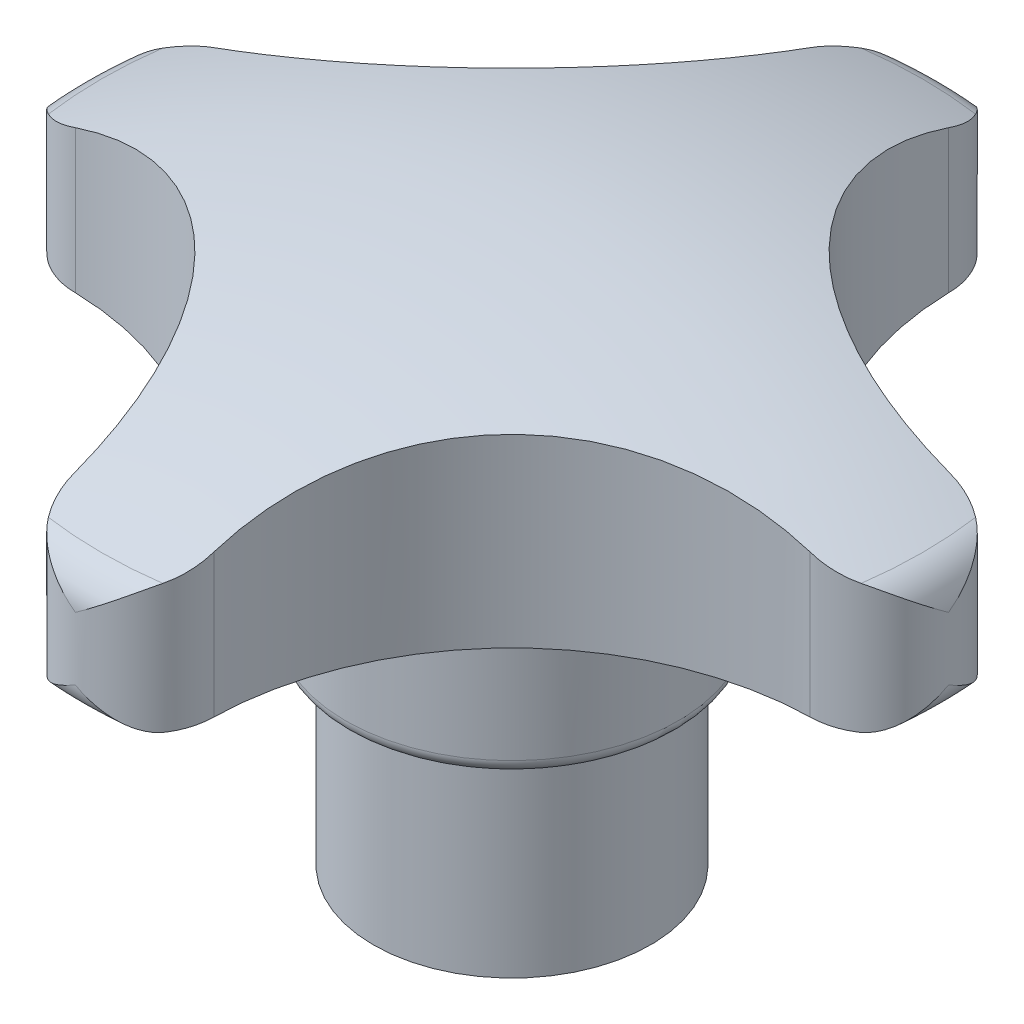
ISO-10303-21;
HEADER;
FILE_DESCRIPTION(('STEP AP214'),'2;1');
FILE_NAME('part.step','',(''),(''),'','','');
FILE_SCHEMA(('AUTOMOTIVE_DESIGN { 1 0 10303 214 1 1 1 1 }'));
ENDSEC;
DATA;
#1=APPLICATION_CONTEXT('core data for automotive mechanical design processes');
#2=APPLICATION_PROTOCOL_DEFINITION('international standard','automotive_design',2000,#1);
#3=PRODUCT_CONTEXT('',#1,'mechanical');
#4=PRODUCT('Part','Part','',(#3));
#5=PRODUCT_RELATED_PRODUCT_CATEGORY('part','',(#4));
#6=PRODUCT_DEFINITION_FORMATION('','',#4);
#7=PRODUCT_DEFINITION_CONTEXT('part definition',#1,'design');
#8=PRODUCT_DEFINITION('design','',#6,#7);
#9=PRODUCT_DEFINITION_SHAPE('','',#8);
#10=(LENGTH_UNIT() NAMED_UNIT(*) SI_UNIT(.MILLI.,.METRE.));
#11=(NAMED_UNIT(*) PLANE_ANGLE_UNIT() SI_UNIT($,.RADIAN.));
#12=(NAMED_UNIT(*) SI_UNIT($,.STERADIAN.) SOLID_ANGLE_UNIT());
#13=UNCERTAINTY_MEASURE_WITH_UNIT(LENGTH_MEASURE(1.E-05),#10,'distance_accuracy_value','');
#14=(GEOMETRIC_REPRESENTATION_CONTEXT(3) GLOBAL_UNCERTAINTY_ASSIGNED_CONTEXT((#13)) GLOBAL_UNIT_ASSIGNED_CONTEXT((#10,
#11,#12)) REPRESENTATION_CONTEXT('',''));
#15=CARTESIAN_POINT('',(0.,0.,0.));
#16=DIRECTION('',(0.,0.,1.));
#17=DIRECTION('',(1.,0.,0.));
#18=AXIS2_PLACEMENT_3D('',#15,#16,#17);
#19=CARTESIAN_POINT('',(0.,24.2000000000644,0.));
#20=DIRECTION('',(0.,-1.,0.));
#21=DIRECTION('',(0.,0.,-1.));
#22=AXIS2_PLACEMENT_3D('',#19,#20,#21);
#23=CONICAL_SURFACE('',#22,5.99999999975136,1.04719755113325);
#24=CARTESIAN_POINT('',(0.,24.2,0.));
#25=DIRECTION('',(0.,1.,0.));
#26=DIRECTION('',(0.,0.,1.));
#27=AXIS2_PLACEMENT_3D('',#24,#25,#26);
#28=CIRCLE('',#27,6.);
#29=CARTESIAN_POINT('',(0.,24.2,6.));
#30=VERTEX_POINT('',#29);
#31=EDGE_CURVE('E401',#30,#30,#28,.F.);
#32=ORIENTED_EDGE('',*,*,#31,.T.);
#33=EDGE_LOOP('',(#32));
#34=FACE_BOUND('',#33,.T.);
#35=CARTESIAN_POINT('',(-8.52651429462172E-11,27.6641016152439,5.68433895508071E-11));
#36=VERTEX_POINT('',#35);
#37=VERTEX_LOOP('',#36);
#38=FACE_BOUND('',#37,.T.);
#39=ADVANCED_FACE('F17',(#34,#38),#23,.F.);
#40=CARTESIAN_POINT('',(0.,13.8320508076,0.));
#41=DIRECTION('',(0.,1.,0.));
#42=DIRECTION('',(0.,0.,1.));
#43=AXIS2_PLACEMENT_3D('',#40,#41,#42);
#44=CYLINDRICAL_SURFACE('',#43,6.);
#45=CARTESIAN_POINT('',(0.,0.99999999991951,0.));
#46=DIRECTION('',(0.,-1.,0.));
#47=DIRECTION('',(0.877582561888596,0.,-0.479425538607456));
#48=AXIS2_PLACEMENT_3D('',#45,#46,#47);
#49=CIRCLE('',#48,5.99999999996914);
#50=CARTESIAN_POINT('',(5.2654953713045,0.99999999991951,-2.87655323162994));
#51=VERTEX_POINT('',#50);
#52=EDGE_CURVE('E392',#51,#51,#49,.T.);
#53=ORIENTED_EDGE('',*,*,#52,.T.);
#54=EDGE_LOOP('',(#53));
#55=FACE_BOUND('',#54,.T.);
#56=ORIENTED_EDGE('',*,*,#31,.F.);
#57=EDGE_LOOP('',(#56));
#58=FACE_BOUND('',#57,.T.);
#59=ADVANCED_FACE('F903',(#55,#58),#44,.F.);
#60=CARTESIAN_POINT('',(0.,5.6843418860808E-11,0.));
#61=DIRECTION('',(0.,-1.,0.));
#62=DIRECTION('',(0.,0.,-1.));
#63=AXIS2_PLACEMENT_3D('',#60,#61,#62);
#64=CONICAL_SURFACE('',#63,6.99999999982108,0.785398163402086);
#65=CARTESIAN_POINT('',(0.,-8.38053584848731E-11,0.));
#66=DIRECTION('',(0.,-1.,0.));
#67=DIRECTION('',(0.,0.,-1.));
#68=AXIS2_PLACEMENT_3D('',#65,#66,#67);
#69=CIRCLE('',#68,6.99999999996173);
#70=CARTESIAN_POINT('',(0.,-8.38053584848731E-11,-6.99999999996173));
#71=VERTEX_POINT('',#70);
#72=EDGE_CURVE('E400',#71,#71,#69,.T.);
#73=ORIENTED_EDGE('',*,*,#72,.T.);
#74=EDGE_LOOP('',(#73));
#75=FACE_BOUND('',#74,.T.);
#76=ORIENTED_EDGE('',*,*,#52,.F.);
#77=EDGE_LOOP('',(#76));
#78=FACE_BOUND('',#77,.T.);
#79=ADVANCED_FACE('F896',(#75,#78),#64,.F.);
#80=CARTESIAN_POINT('',(10.,0.,0.));
#81=DIRECTION('',(0.,1.,0.));
#82=DIRECTION('',(0.,0.,1.));
#83=AXIS2_PLACEMENT_3D('',#80,#81,#82);
#84=PLANE('',#83);
#85=ORIENTED_EDGE('',*,*,#72,.F.);
#86=EDGE_LOOP('',(#85));
#87=FACE_BOUND('',#86,.T.);
#88=CARTESIAN_POINT('',(0.,0.,0.));
#89=DIRECTION('',(0.,1.,0.));
#90=DIRECTION('',(0.,0.,1.));
#91=AXIS2_PLACEMENT_3D('',#88,#89,#90);
#92=CIRCLE('',#91,10.);
#93=CARTESIAN_POINT('',(0.,0.,10.));
#94=VERTEX_POINT('',#93);
#95=EDGE_CURVE('E925',#94,#94,#92,.T.);
#96=ORIENTED_EDGE('',*,*,#95,.F.);
#97=EDGE_LOOP('',(#96));
#98=FACE_BOUND('',#97,.T.);
#99=ADVANCED_FACE('F889',(#87,#98),#84,.F.);
#100=CARTESIAN_POINT('',(0.,20.,0.));
#101=DIRECTION('',(0.,1.,0.));
#102=DIRECTION('',(0.,0.,1.));
#103=AXIS2_PLACEMENT_3D('',#100,#101,#102);
#104=CYLINDRICAL_SURFACE('',#103,10.);
#105=ORIENTED_EDGE('',*,*,#95,.T.);
#106=EDGE_LOOP('',(#105));
#107=FACE_BOUND('',#106,.T.);
#108=CARTESIAN_POINT('',(0.,14.,0.));
#109=DIRECTION('',(0.,1.,0.));
#110=DIRECTION('',(0.,0.,1.));
#111=AXIS2_PLACEMENT_3D('',#108,#109,#110);
#112=CIRCLE('',#111,10.);
#113=CARTESIAN_POINT('',(0.,14.,10.));
#114=VERTEX_POINT('',#113);
#115=EDGE_CURVE('E928',#114,#114,#112,.F.);
#116=ORIENTED_EDGE('',*,*,#115,.T.);
#117=EDGE_LOOP('',(#116));
#118=FACE_BOUND('',#117,.T.);
#119=ADVANCED_FACE('F375',(#107,#118),#104,.T.);
#120=CARTESIAN_POINT('',(11.,14.,0.));
#121=DIRECTION('',(0.,1.,0.));
#122=DIRECTION('',(0.,0.,1.));
#123=AXIS2_PLACEMENT_3D('',#120,#121,#122);
#124=PLANE('',#123);
#125=ORIENTED_EDGE('',*,*,#115,.F.);
#126=EDGE_LOOP('',(#125));
#127=FACE_BOUND('',#126,.T.);
#128=CARTESIAN_POINT('',(0.,14.,0.));
#129=DIRECTION('',(0.,1.,0.));
#130=DIRECTION('',(-0.877582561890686,0.,0.479425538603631));
#131=AXIS2_PLACEMENT_3D('',#128,#129,#130);
#132=CIRCLE('',#131,10.9999999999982);
#133=CARTESIAN_POINT('',(-9.65340818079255,14.,5.27368092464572));
#134=VERTEX_POINT('',#133);
#135=CARTESIAN_POINT('',(9.65340818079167,14.,-5.27368092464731));
#136=VERTEX_POINT('',#135);
#137=EDGE_CURVE('E361',#134,#136,#132,.T.);
#138=ORIENTED_EDGE('',*,*,#137,.F.);
#139=CARTESIAN_POINT('',(0.,14.,0.));
#140=DIRECTION('',(0.,1.,0.));
#141=DIRECTION('',(0.877582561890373,0.,-0.479425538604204));
#142=AXIS2_PLACEMENT_3D('',#139,#140,#141);
#143=CIRCLE('',#142,10.9999999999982);
#144=EDGE_CURVE('E941',#136,#134,#143,.T.);
#145=ORIENTED_EDGE('',*,*,#144,.F.);
#146=EDGE_LOOP('',(#138,#145));
#147=FACE_BOUND('',#146,.T.);
#148=ADVANCED_FACE('F366',(#127,#147),#124,.F.);
#149=CARTESIAN_POINT('',(0.,15.,0.));
#150=DIRECTION('',(0.,1.,0.));
#151=DIRECTION('',(0.877582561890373,0.,-0.479425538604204));
#152=AXIS2_PLACEMENT_3D('',#149,#150,#151);
#153=TOROIDAL_SURFACE('',#152,11.,1.);
#154=ORIENTED_EDGE('',*,*,#144,.T.);
#155=ORIENTED_EDGE('',*,*,#137,.T.);
#156=EDGE_LOOP('',(#154,#155));
#157=FACE_BOUND('',#156,.T.);
#158=CARTESIAN_POINT('',(0.,15.,0.));
#159=DIRECTION('',(0.,1.,0.));
#160=DIRECTION('',(0.,0.,1.));
#161=AXIS2_PLACEMENT_3D('',#158,#159,#160);
#162=CIRCLE('',#161,12.);
#163=CARTESIAN_POINT('',(0.,15.,12.));
#164=VERTEX_POINT('',#163);
#165=EDGE_CURVE('E176',#164,#164,#162,.T.);
#166=ORIENTED_EDGE('',*,*,#165,.F.);
#167=EDGE_LOOP('',(#166));
#168=FACE_BOUND('',#167,.T.);
#169=ADVANCED_FACE('F339',(#157,#168),#153,.T.);
#170=CARTESIAN_POINT('',(0.,31.5314616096,0.));
#171=DIRECTION('',(0.,1.,0.));
#172=DIRECTION('',(0.877582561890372,0.,-0.479425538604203));
#173=AXIS2_PLACEMENT_3D('',#170,#171,#172);
#174=TOROIDAL_SURFACE('',#173,28.5,3.);
#175=CARTESIAN_POINT('',(0.,34.3184016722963,0.));
#176=DIRECTION('',(0.,1.,0.));
#177=DIRECTION('',(0.877582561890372,0.,-0.479425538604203));
#178=AXIS2_PLACEMENT_3D('',#175,#176,#177);
#179=CIRCLE('',#178,29.6103896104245);
#180=CARTESIAN_POINT('',(29.3212296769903,34.3184016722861,4.12803380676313));
#181=VERTEX_POINT('',#180);
#182=CARTESIAN_POINT('',(29.3212296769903,34.3184016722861,-4.12803380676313));
#183=VERTEX_POINT('',#182);
#184=EDGE_CURVE('E354',#181,#183,#179,.T.);
#185=ORIENTED_EDGE('',*,*,#184,.F.);
#186=CARTESIAN_POINT('',(29.3212296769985,34.3184016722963,4.1280338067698));
#187=CARTESIAN_POINT('',(29.3640143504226,34.303145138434,4.09879220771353));
#188=CARTESIAN_POINT('',(29.4061775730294,34.2872272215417,4.06899222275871));
#189=CARTESIAN_POINT('',(29.4903369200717,34.2537186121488,4.00754452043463));
#190=CARTESIAN_POINT('',(29.5322995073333,34.2360949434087,3.97586882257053));
#191=CARTESIAN_POINT('',(29.6159573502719,34.1991601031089,3.9106435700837));
#192=CARTESIAN_POINT('',(29.6576171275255,34.1798169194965,3.87706669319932));
#193=CARTESIAN_POINT('',(29.7405665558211,34.1394308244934,3.80801261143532));
#194=CARTESIAN_POINT('',(29.7818188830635,34.1183569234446,3.77250872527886));
#195=CARTESIAN_POINT('',(29.8638465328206,34.0745018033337,3.69957616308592));
#196=CARTESIAN_POINT('',(29.9045827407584,34.0516907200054,3.6621214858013));
#197=CARTESIAN_POINT('',(29.9854678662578,34.0043579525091,3.58526453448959));
#198=CARTESIAN_POINT('',(30.025575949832,33.9798076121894,3.54583696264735));
#199=CARTESIAN_POINT('',(30.1050909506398,33.9289979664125,3.46501342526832));
#200=CARTESIAN_POINT('',(30.1444553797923,33.9027113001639,3.42359289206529));
#201=CARTESIAN_POINT('',(30.2223667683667,33.8484349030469,3.33876500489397));
#202=CARTESIAN_POINT('',(30.2608696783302,33.8204191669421,3.29533384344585));
#203=CARTESIAN_POINT('',(30.3299809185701,33.7679759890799,3.21459356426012));
#204=CARTESIAN_POINT('',(30.3608632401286,33.7436958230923,3.1774228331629));
#205=CARTESIAN_POINT('',(30.4222138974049,33.6937632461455,3.1013740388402));
#206=CARTESIAN_POINT('',(30.4526438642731,33.668091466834,3.06247780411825));
#207=CARTESIAN_POINT('',(30.5444403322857,33.587879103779,2.94152301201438));
#208=CARTESIAN_POINT('',(30.6035316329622,33.5322514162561,2.85844460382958));
#209=CARTESIAN_POINT('',(30.71896770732,33.4154524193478,2.68536506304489));
#210=CARTESIAN_POINT('',(30.7749798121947,33.3541446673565,2.59523518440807));
#211=CARTESIAN_POINT('',(30.8833658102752,33.2259749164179,2.40797189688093));
#212=CARTESIAN_POINT('',(30.9353908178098,33.1589906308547,2.31072013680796));
#213=CARTESIAN_POINT('',(31.02428429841,33.0343726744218,2.13055555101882));
#214=CARTESIAN_POINT('',(31.0622330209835,32.9770453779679,2.04796010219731));
#215=CARTESIAN_POINT('',(31.1360818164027,32.8566697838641,1.87508424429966));
#216=CARTESIAN_POINT('',(31.1715929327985,32.7935233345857,1.78470580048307));
#217=CARTESIAN_POINT('',(31.2394608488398,32.6614379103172,1.59620612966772));
#218=CARTESIAN_POINT('',(31.2714032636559,32.5924105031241,1.49799798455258));
#219=CARTESIAN_POINT('',(31.3309430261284,32.4485669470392,1.29383169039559));
#220=CARTESIAN_POINT('',(31.358100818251,32.3736748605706,1.18779833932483));
#221=CARTESIAN_POINT('',(31.3964373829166,32.2513358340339,1.01465505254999));
#222=CARTESIAN_POINT('',(31.4097901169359,32.2041228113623,0.947851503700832));
#223=CARTESIAN_POINT('',(31.4364506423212,32.0986727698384,0.79878369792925));
#224=CARTESIAN_POINT('',(31.4490627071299,32.0403618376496,0.716446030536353));
#225=CARTESIAN_POINT('',(31.4721037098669,31.9125703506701,0.536247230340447));
#226=CARTESIAN_POINT('',(31.4816980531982,31.8430176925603,0.438330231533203));
#227=CARTESIAN_POINT('',(31.4961341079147,31.6928095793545,0.226978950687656));
#228=CARTESIAN_POINT('',(31.5000014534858,31.6121139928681,0.113505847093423));
#229=CARTESIAN_POINT('',(31.5,31.5314616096,1.02348685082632E-13));
#230=B_SPLINE_CURVE_WITH_KNOTS('',3,(#186,#187,#188,#189,#190,#191,#192,#193,#194,#195,#196,
#197,#198,#199,#200,#201,#202,#203,#204,#205,#206,#207,#208,#209,#210,#211,#212,#213,#214,#215,
#216,#217,#218,#219,#220,#221,#222,#223,#224,#225,#226,#227,#228,#229),.UNSPECIFIED.,.F.,.F.,(4,
2,2,2,2,2,2,2,2,2,2,2,2,2,2,2,2,2,2,2,2,4),(0.,0.162050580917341,0.328361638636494,
0.49900770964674,0.674059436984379,0.853583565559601,1.0376429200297,1.22629636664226,
1.41959876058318,1.58182238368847,1.74877920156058,2.09697176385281,2.46442235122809,
2.8512987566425,3.17357267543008,3.52091439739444,3.89339828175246,4.29105604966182,
4.53967321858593,4.84462345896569,5.20594799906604,5.62361431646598),.UNSPECIFIED.);
#231=CARTESIAN_POINT('',(31.5,31.5314616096,0.));
#232=VERTEX_POINT('',#231);
#233=EDGE_CURVE('E1045',#232,#181,#230,.F.);
#234=ORIENTED_EDGE('',*,*,#233,.F.);
#235=CARTESIAN_POINT('',(31.5,31.5314616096,1.02348685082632E-13));
#236=CARTESIAN_POINT('',(31.5000018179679,31.616415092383,-0.119557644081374));
#237=CARTESIAN_POINT('',(31.4957107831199,31.7014235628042,-0.239074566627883));
#238=CARTESIAN_POINT('',(31.4796476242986,31.8600539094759,-0.462237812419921));
#239=CARTESIAN_POINT('',(31.4689199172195,31.9337202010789,-0.565928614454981));
#240=CARTESIAN_POINT('',(31.4430387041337,32.0694984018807,-0.757385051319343));
#241=CARTESIAN_POINT('',(31.4287861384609,32.1316918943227,-0.845214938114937));
#242=CARTESIAN_POINT('',(31.3984649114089,32.2446672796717,-1.00497744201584));
#243=CARTESIAN_POINT('',(31.3831543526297,32.2955357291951,-1.07699398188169));
#244=CARTESIAN_POINT('',(31.3416311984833,32.4197588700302,-1.25294082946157));
#245=CARTESIAN_POINT('',(31.3136170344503,32.4928995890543,-1.35660390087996));
#246=CARTESIAN_POINT('',(31.2526729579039,32.6333745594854,-1.55622660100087));
#247=CARTESIAN_POINT('',(31.2201623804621,32.700784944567,-1.65226108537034));
#248=CARTESIAN_POINT('',(31.1514065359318,32.8297859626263,-1.83661863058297));
#249=CARTESIAN_POINT('',(31.1155568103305,32.8914641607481,-1.92502765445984));
#250=CARTESIAN_POINT('',(31.0412227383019,33.0090635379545,-2.09417483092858));
#251=CARTESIAN_POINT('',(31.0031099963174,33.0650810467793,-2.17500950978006));
#252=CARTESIAN_POINT('',(30.9142783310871,33.1865102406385,-2.35083271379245));
#253=CARTESIAN_POINT('',(30.8625493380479,33.2516298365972,-2.44551602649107));
#254=CARTESIAN_POINT('',(30.7549076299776,33.3763898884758,-2.62804824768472));
#255=CARTESIAN_POINT('',(30.6993130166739,33.4361434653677,-2.71600752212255));
#256=CARTESIAN_POINT('',(30.5847802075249,33.5501379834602,-2.88514513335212));
#257=CARTESIAN_POINT('',(30.5261459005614,33.6045052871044,-2.96644312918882));
#258=CARTESIAN_POINT('',(30.4351088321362,33.682954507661,-3.08489679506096));
#259=CARTESIAN_POINT('',(30.4048995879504,33.708099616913,-3.12304767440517));
#260=CARTESIAN_POINT('',(30.3439767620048,33.7570442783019,-3.19770040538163));
#261=CARTESIAN_POINT('',(30.3132983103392,33.7808618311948,-3.23421906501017));
#262=CARTESIAN_POINT('',(30.2448449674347,33.8321733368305,-3.31335152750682));
#263=CARTESIAN_POINT('',(30.2068122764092,33.8595261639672,-3.35583426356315));
#264=CARTESIAN_POINT('',(30.1299114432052,33.9125103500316,-3.43881086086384));
#265=CARTESIAN_POINT('',(30.0910860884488,33.9381673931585,-3.47932796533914));
#266=CARTESIAN_POINT('',(30.012715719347,33.9877558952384,-3.55839007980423));
#267=CARTESIAN_POINT('',(29.9732119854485,34.0117142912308,-3.59695908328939));
#268=CARTESIAN_POINT('',(29.8935985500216,34.0579052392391,-3.67214459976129));
#269=CARTESIAN_POINT('',(29.8535285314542,34.0801659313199,-3.70878581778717));
#270=CARTESIAN_POINT('',(29.7728925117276,34.1229661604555,-3.78013710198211));
#271=CARTESIAN_POINT('',(29.7323645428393,34.1435349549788,-3.81487256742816));
#272=CARTESIAN_POINT('',(29.6509192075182,34.1829603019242,-3.88243524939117));
#273=CARTESIAN_POINT('',(29.6100381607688,34.2018471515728,-3.91528854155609));
#274=CARTESIAN_POINT('',(29.5279891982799,34.2379221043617,-3.97911170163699));
#275=CARTESIAN_POINT('',(29.4868558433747,34.2551414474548,-4.01010828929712));
#276=CARTESIAN_POINT('',(29.4044021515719,34.2878973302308,-4.07024229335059));
#277=CARTESIAN_POINT('',(29.363114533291,34.3034659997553,-4.09940709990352));
#278=CARTESIAN_POINT('',(29.3212296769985,34.3184016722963,-4.12803380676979));
#279=B_SPLINE_CURVE_WITH_KNOTS('',3,(#235,#236,#237,#238,#239,#240,#241,#242,#243,#244,#245,
#246,#247,#248,#249,#250,#251,#252,#253,#254,#255,#256,#257,#258,#259,#260,#261,#262,#263,#264,
#265,#266,#267,#268,#269,#270,#271,#272,#273,#274,#275,#276,#277,#278),.UNSPECIFIED.,.F.,.F.,(4,
2,2,2,2,2,2,2,2,2,2,2,2,2,2,2,2,2,2,2,2,4),(0.,0.439930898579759,0.822703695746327,
1.14827620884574,1.41669187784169,1.8062612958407,2.17135916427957,2.51202358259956,
2.82833241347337,3.20616586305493,3.56594188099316,3.90782125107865,4.07212815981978,
4.23203811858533,4.42172042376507,4.6067914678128,4.7873040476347,4.9633147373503,
5.13488384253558,5.30207537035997,5.46495701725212,5.62360017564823),.UNSPECIFIED.);
#280=EDGE_CURVE('E325',#183,#232,#279,.F.);
#281=ORIENTED_EDGE('',*,*,#280,.F.);
#282=EDGE_LOOP('',(#185,#234,#281));
#283=FACE_BOUND('',#282,.T.);
#284=ADVANCED_FACE('F331',(#283),#174,.T.);
#285=CARTESIAN_POINT('',(0.,31.5314616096,0.));
#286=DIRECTION('',(0.,1.,0.));
#287=DIRECTION('',(0.877582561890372,0.,-0.479425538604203));
#288=AXIS2_PLACEMENT_3D('',#285,#286,#287);
#289=TOROIDAL_SURFACE('',#288,28.5,3.);
#290=CARTESIAN_POINT('',(0.,34.3184016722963,0.));
#291=DIRECTION('',(0.,1.,0.));
#292=DIRECTION('',(0.877582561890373,0.,-0.479425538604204));
#293=AXIS2_PLACEMENT_3D('',#290,#291,#292);
#294=CIRCLE('',#293,29.6103896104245);
#295=CARTESIAN_POINT('',(4.12803380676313,34.3184016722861,-29.3212296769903));
#296=VERTEX_POINT('',#295);
#297=CARTESIAN_POINT('',(-4.12803380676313,34.3184016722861,-29.3212296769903));
#298=VERTEX_POINT('',#297);
#299=EDGE_CURVE('E943',#296,#298,#294,.T.);
#300=ORIENTED_EDGE('',*,*,#299,.F.);
#301=CARTESIAN_POINT('',(4.12803380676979,34.3184016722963,-29.3212296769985));
#302=CARTESIAN_POINT('',(4.09879218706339,34.3031451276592,-29.3640143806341));
#303=CARTESIAN_POINT('',(4.0689921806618,34.2872271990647,-29.4061776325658));
#304=CARTESIAN_POINT('',(4.00754443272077,34.2537185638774,-29.4903370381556));
#305=CARTESIAN_POINT('',(3.9758687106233,34.2360948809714,-29.5322996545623));
#306=CARTESIAN_POINT('',(3.91064340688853,34.1991600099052,-29.6159575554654));
#307=CARTESIAN_POINT('',(3.87706650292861,34.1798168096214,-29.6576173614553));
#308=CARTESIAN_POINT('',(3.80801236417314,34.1394306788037,-29.740566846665));
#309=CARTESIAN_POINT('',(3.77250844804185,34.1183567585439,-29.781819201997));
#310=CARTESIAN_POINT('',(3.69957582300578,34.0745015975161,-29.863846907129));
#311=CARTESIAN_POINT('',(3.66212111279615,34.0516904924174,-29.9045831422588));
#312=CARTESIAN_POINT('',(3.58526409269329,34.0043576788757,-29.9854683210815));
#313=CARTESIAN_POINT('',(3.54583648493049,33.9798073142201,-30.0255764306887));
#314=CARTESIAN_POINT('',(3.46501287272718,33.928997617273,-30.1050914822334));
#315=CARTESIAN_POINT('',(3.42359230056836,33.9027109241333,-30.1444559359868));
#316=CARTESIAN_POINT('',(3.33876433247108,33.8484344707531,-30.22236737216));
#317=CARTESIAN_POINT('',(3.29533312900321,33.8204187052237,-30.260870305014));
#318=CARTESIAN_POINT('',(3.21459277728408,33.7679754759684,-30.3299815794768));
#319=CARTESIAN_POINT('',(3.17742201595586,33.7436952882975,-30.3608639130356));
#320=CARTESIAN_POINT('',(3.10137315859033,33.6937626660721,-30.4222145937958));
#321=CARTESIAN_POINT('',(3.06247689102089,33.6680908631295,-30.4526445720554));
#322=CARTESIAN_POINT('',(2.94152199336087,33.5878784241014,-30.5444410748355));
#323=CARTESIAN_POINT('',(2.85844351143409,33.5322506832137,-30.6035323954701));
#324=CARTESIAN_POINT('',(2.68536381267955,33.4154515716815,-30.7189685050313));
#325=CARTESIAN_POINT('',(2.59523384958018,33.3541437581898,-30.7749806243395));
#326=CARTESIAN_POINT('',(2.40797038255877,33.2259738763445,-30.8833666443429));
#327=CARTESIAN_POINT('',(2.31071852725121,33.1589895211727,-30.935391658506));
#328=CARTESIAN_POINT('',(2.13055378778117,33.0343714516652,-31.0242851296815));
#329=CARTESIAN_POINT('',(2.04795828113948,32.9770441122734,-31.0622338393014));
#330=CARTESIAN_POINT('',(1.87508229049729,32.8566684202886,-31.1360826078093));
#331=CARTESIAN_POINT('',(1.78470377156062,32.7935219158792,-31.171593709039));
#332=CARTESIAN_POINT('',(1.59620393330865,32.6614363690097,-31.2394615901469));
#333=CARTESIAN_POINT('',(1.49799569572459,32.5924088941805,-31.2714039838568));
#334=CARTESIAN_POINT('',(1.29382919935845,32.4485651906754,-31.3309436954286));
#335=CARTESIAN_POINT('',(1.18779573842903,32.3736730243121,-31.3581014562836));
#336=CARTESIAN_POINT('',(1.01465250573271,32.2513340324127,-31.3964379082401));
#337=CARTESIAN_POINT('',(0.947849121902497,32.2041211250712,-31.4097905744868));
#338=CARTESIAN_POINT('',(0.798781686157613,32.0986713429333,-31.4364509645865));
#339=CARTESIAN_POINT('',(0.71644422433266,32.0403605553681,-31.4490629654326));
#340=CARTESIAN_POINT('',(0.536245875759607,31.9125693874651,-31.472103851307));
#341=CARTESIAN_POINT('',(0.438329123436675,31.8430169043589,-31.4816981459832));
#342=CARTESIAN_POINT('',(0.226978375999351,31.6928091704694,-31.4961341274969));
#343=CARTESIAN_POINT('',(0.113505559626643,31.6121137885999,-31.50000145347));
#344=CARTESIAN_POINT('',(0.,31.5314616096,-31.5));
#345=B_SPLINE_CURVE_WITH_KNOTS('',3,(#301,#302,#303,#304,#305,#306,#307,#308,#309,#310,#311,
#312,#313,#314,#315,#316,#317,#318,#319,#320,#321,#322,#323,#324,#325,#326,#327,#328,#329,#330,
#331,#332,#333,#334,#335,#336,#337,#338,#339,#340,#341,#342,#343,#344),.UNSPECIFIED.,.F.,.F.,(4,
2,2,2,2,2,2,2,2,2,2,2,2,2,2,2,2,2,2,2,2,4),(0.,0.162050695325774,0.328361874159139,
0.499008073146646,0.674059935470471,0.85358420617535,1.03764371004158,1.2262973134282,
1.41959987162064,1.58182360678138,1.74878054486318,2.09697337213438,2.46442425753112,
2.85130099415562,3.17357510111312,3.52091707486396,3.89340127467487,4.29105942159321,
4.53967596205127,4.84462543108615,5.20594905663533,5.62361431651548),.UNSPECIFIED.);
#346=CARTESIAN_POINT('',(0.,31.5314616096,-31.5));
#347=VERTEX_POINT('',#346);
#348=EDGE_CURVE('E311',#347,#296,#345,.F.);
#349=ORIENTED_EDGE('',*,*,#348,.F.);
#350=CARTESIAN_POINT('',(0.,31.5314616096,-31.5));
#351=CARTESIAN_POINT('',(-0.119557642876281,31.6164150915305,-31.5000018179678));
#352=CARTESIAN_POINT('',(-0.239074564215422,31.7014235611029,-31.4957107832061));
#353=CARTESIAN_POINT('',(-0.462237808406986,31.8600539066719,-31.4796476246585));
#354=CARTESIAN_POINT('',(-0.565928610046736,31.9337201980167,-31.4689199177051));
#355=CARTESIAN_POINT('',(-0.757385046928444,32.0694983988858,-31.4430387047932));
#356=CARTESIAN_POINT('',(-0.84521493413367,32.1316918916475,-31.4287861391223));
#357=CARTESIAN_POINT('',(-1.00497743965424,32.2446672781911,-31.3984649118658));
#358=CARTESIAN_POINT('',(-1.07699398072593,32.2955357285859,-31.3831543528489));
#359=CARTESIAN_POINT('',(-1.25294082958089,32.4197588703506,-31.3416311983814));
#360=CARTESIAN_POINT('',(-1.35660390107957,32.4928995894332,-31.3136170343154));
#361=CARTESIAN_POINT('',(-1.55622660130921,32.6333745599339,-31.2526729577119));
#362=CARTESIAN_POINT('',(-1.65226108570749,32.7007849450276,-31.2201623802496));
#363=CARTESIAN_POINT('',(-1.83661863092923,32.8297859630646,-31.1514065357));
#364=CARTESIAN_POINT('',(-1.92502765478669,32.8914641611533,-31.1155568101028));
#365=CARTESIAN_POINT('',(-2.09417483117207,33.0090635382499,-31.0412227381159));
#366=CARTESIAN_POINT('',(-2.17500950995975,33.0650810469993,-31.0031099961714));
#367=CARTESIAN_POINT('',(-2.35083271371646,33.1865102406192,-30.9142783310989));
#368=CARTESIAN_POINT('',(-2.44551602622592,33.2516298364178,-30.8625493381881));
#369=CARTESIAN_POINT('',(-2.62804824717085,33.3763898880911,-30.7549076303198));
#370=CARTESIAN_POINT('',(-2.71600752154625,33.4361434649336,-30.6993130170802));
#371=CARTESIAN_POINT('',(-2.88514513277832,33.5501379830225,-30.5847802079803));
#372=CARTESIAN_POINT('',(-2.96644312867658,33.6045052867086,-30.5261459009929));
#373=CARTESIAN_POINT('',(-3.08489679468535,33.6829545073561,-30.4351088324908));
#374=CARTESIAN_POINT('',(-3.12304767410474,33.7080996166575,-30.4048995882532));
#375=CARTESIAN_POINT('',(-3.19770040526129,33.7570442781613,-30.3439767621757));
#376=CARTESIAN_POINT('',(-3.23421906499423,33.780861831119,-30.3132983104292));
#377=CARTESIAN_POINT('',(-3.31335152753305,33.8321733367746,-30.2448449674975));
#378=CARTESIAN_POINT('',(-3.35583426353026,33.8595261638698,-30.2068122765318));
#379=CARTESIAN_POINT('',(-3.43881086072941,33.9125103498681,-30.1299114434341));
#380=CARTESIAN_POINT('',(-3.47932796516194,33.9381673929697,-30.0910860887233));
#381=CARTESIAN_POINT('',(-3.55839007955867,33.9877558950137,-30.0127157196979));
#382=CARTESIAN_POINT('',(-3.59695908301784,34.0117142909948,-29.9732119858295));
#383=CARTESIAN_POINT('',(-3.67214459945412,34.0579052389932,-29.893598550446));
#384=CARTESIAN_POINT('',(-3.70878581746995,34.0801659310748,-29.8535285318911));
#385=CARTESIAN_POINT('',(-3.78013710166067,34.1229661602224,-29.7728925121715));
#386=CARTESIAN_POINT('',(-3.81487256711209,34.1435349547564,-29.7323645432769));
#387=CARTESIAN_POINT('',(-3.88243524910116,34.1829603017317,-29.6509192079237));
#388=CARTESIAN_POINT('',(-3.91528854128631,34.201847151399,-29.6100381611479));
#389=CARTESIAN_POINT('',(-3.97911170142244,34.2379221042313,-29.5279891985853));
#390=CARTESIAN_POINT('',(-4.01010828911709,34.2551414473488,-29.4868558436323));
#391=CARTESIAN_POINT('',(-4.07024229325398,34.2878973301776,-29.4044021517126));
#392=CARTESIAN_POINT('',(-4.09940709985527,34.30346599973,-29.3631145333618));
#393=CARTESIAN_POINT('',(-4.12803380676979,34.3184016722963,-29.3212296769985));
#394=B_SPLINE_CURVE_WITH_KNOTS('',3,(#350,#351,#352,#353,#354,#355,#356,#357,#358,#359,#360,
#361,#362,#363,#364,#365,#366,#367,#368,#369,#370,#371,#372,#373,#374,#375,#376,#377,#378,#379,
#380,#381,#382,#383,#384,#385,#386,#387,#388,#389,#390,#391,#392,#393),.UNSPECIFIED.,.F.,.F.,(4,
2,2,2,2,2,2,2,2,2,2,2,2,2,2,2,2,2,2,2,2,4),(0.,0.439930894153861,0.822703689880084,
1.14827620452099,1.41669187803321,1.80626129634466,2.17135916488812,2.51202358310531,
2.82833241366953,3.20616586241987,3.56594188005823,3.90782125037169,4.0721281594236,
4.23203811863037,4.42172042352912,4.60679146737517,4.78730404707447,4.96331473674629,
5.13488384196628,5.30207536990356,5.46495701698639,5.62360017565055),.UNSPECIFIED.);
#395=EDGE_CURVE('E300',#298,#347,#394,.F.);
#396=ORIENTED_EDGE('',*,*,#395,.F.);
#397=EDGE_LOOP('',(#300,#349,#396));
#398=FACE_BOUND('',#397,.T.);
#399=ADVANCED_FACE('F281',(#398),#289,.T.);
#400=CARTESIAN_POINT('',(0.,31.5314616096,0.));
#401=DIRECTION('',(0.,1.,0.));
#402=DIRECTION('',(0.877582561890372,0.,-0.479425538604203));
#403=AXIS2_PLACEMENT_3D('',#400,#401,#402);
#404=TOROIDAL_SURFACE('',#403,28.5,3.);
#405=CARTESIAN_POINT('',(0.,34.3184016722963,0.));
#406=DIRECTION('',(0.,1.,0.));
#407=DIRECTION('',(0.877582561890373,0.,-0.479425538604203));
#408=AXIS2_PLACEMENT_3D('',#405,#406,#407);
#409=CIRCLE('',#408,29.6103896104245);
#410=CARTESIAN_POINT('',(-29.3212296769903,34.3184016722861,-4.12803380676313));
#411=VERTEX_POINT('',#410);
#412=CARTESIAN_POINT('',(-29.3212296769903,34.3184016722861,4.12803380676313));
#413=VERTEX_POINT('',#412);
#414=EDGE_CURVE('E462',#411,#413,#409,.T.);
#415=ORIENTED_EDGE('',*,*,#414,.F.);
#416=CARTESIAN_POINT('',(-29.3212296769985,34.3184016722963,-4.12803380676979));
#417=CARTESIAN_POINT('',(-29.3640143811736,34.3031451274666,-4.09879218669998));
#418=CARTESIAN_POINT('',(-29.4061776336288,34.2872271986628,-4.06899217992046));
#419=CARTESIAN_POINT('',(-29.4903370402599,34.2537185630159,-4.00754443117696));
#420=CARTESIAN_POINT('',(-29.5322996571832,34.2360948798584,-3.97586870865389));
#421=CARTESIAN_POINT('',(-29.61595755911,34.1991600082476,-3.91064340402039));
#422=CARTESIAN_POINT('',(-29.6576173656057,34.1798168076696,-3.87706649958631));
#423=CARTESIAN_POINT('',(-29.7405668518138,34.1394306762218,-3.80801235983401));
#424=CARTESIAN_POINT('',(-29.7818192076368,34.1183567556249,-3.77250844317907));
#425=CARTESIAN_POINT('',(-29.8638469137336,34.0745015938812,-3.69957581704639));
#426=CARTESIAN_POINT('',(-29.9045831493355,34.0516904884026,-3.66212110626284));
#427=CARTESIAN_POINT('',(-29.9854683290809,34.0043576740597,-3.58526408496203));
#428=CARTESIAN_POINT('',(-30.025576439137,33.9798073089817,-3.54583647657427));
#429=CARTESIAN_POINT('',(-30.1050914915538,33.9289976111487,-3.4650128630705));
#430=CARTESIAN_POINT('',(-30.1444559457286,33.9027109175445,-3.4235922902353));
#431=CARTESIAN_POINT('',(-30.2223673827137,33.8484344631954,-3.33876432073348));
#432=CARTESIAN_POINT('',(-30.2608703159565,33.8204186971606,-3.2953331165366));
#433=CARTESIAN_POINT('',(-30.3299815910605,33.7679754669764,-3.21459276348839));
#434=CARTESIAN_POINT('',(-30.3608639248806,33.7436952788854,-3.17742200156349));
#435=CARTESIAN_POINT('',(-30.4222146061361,33.6937626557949,-3.10137314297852));
#436=CARTESIAN_POINT('',(-30.4526445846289,33.668090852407,-3.06247687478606));
#437=CARTESIAN_POINT('',(-30.5444410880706,33.5878784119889,-2.94152197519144));
#438=CARTESIAN_POINT('',(-30.603532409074,33.5322506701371,-2.85844349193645));
#439=CARTESIAN_POINT('',(-30.7189685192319,33.415451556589,-2.6853637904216));
#440=CARTESIAN_POINT('',(-30.7749806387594,33.3541437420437,-2.59523382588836));
#441=CARTESIAN_POINT('',(-30.883366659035,33.2259738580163,-2.40797035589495));
#442=CARTESIAN_POINT('',(-30.935391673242,33.1589895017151,-2.31071849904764));
#443=CARTESIAN_POINT('',(-31.0242851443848,33.0343714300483,-2.13055375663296));
#444=CARTESIAN_POINT('',(-31.0622338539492,32.9770440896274,-2.04795824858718));
#445=CARTESIAN_POINT('',(-31.1360826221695,32.8566683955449,-1.87508225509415));
#446=CARTESIAN_POINT('',(-31.1715937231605,32.793521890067,-1.78470373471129));
#447=CARTESIAN_POINT('',(-31.2394616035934,32.661436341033,-1.59620389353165));
#448=CARTESIAN_POINT('',(-31.2714039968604,32.5924088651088,-1.49799565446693));
#449=CARTESIAN_POINT('',(-31.3309437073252,32.4485651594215,-1.29382915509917));
#450=CARTESIAN_POINT('',(-31.3581014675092,32.3736729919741,-1.18779569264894));
#451=CARTESIAN_POINT('',(-31.3964379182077,32.2513339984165,-1.01465245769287));
#452=CARTESIAN_POINT('',(-31.4097905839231,32.2041210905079,-0.947849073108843));
#453=CARTESIAN_POINT('',(-31.4364509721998,32.0986713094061,-0.798781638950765));
#454=CARTESIAN_POINT('',(-31.4490629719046,32.0403605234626,-0.716444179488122));
#455=CARTESIAN_POINT('',(-31.4721038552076,31.9125693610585,-0.536245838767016));
#456=CARTESIAN_POINT('',(-31.4816981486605,31.8430168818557,-0.438329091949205));
#457=CARTESIAN_POINT('',(-31.4961341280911,31.6928091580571,-0.226978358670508));
#458=CARTESIAN_POINT('',(-31.5000014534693,31.6121137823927,-0.113505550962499));
#459=CARTESIAN_POINT('',(-31.5,31.5314616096,0.));
#460=B_SPLINE_CURVE_WITH_KNOTS('',3,(#416,#417,#418,#419,#420,#421,#422,#423,#424,#425,#426,
#427,#428,#429,#430,#431,#432,#433,#434,#435,#436,#437,#438,#439,#440,#441,#442,#443,#444,#445,
#446,#447,#448,#449,#450,#451,#452,#453,#454,#455,#456,#457,#458,#459),.UNSPECIFIED.,.F.,.F.,(4,
2,2,2,2,2,2,2,2,2,2,2,2,2,2,2,2,2,2,2,2,4),(0.,0.162050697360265,0.328361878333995,
0.499008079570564,0.674059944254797,0.853584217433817,1.03764372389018,1.22629732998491,
1.41959989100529,1.58182362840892,1.74878056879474,2.0969734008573,2.46442429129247,
2.85130103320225,3.17357514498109,3.52091712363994,3.89340132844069,4.29105948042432,
4.53967602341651,4.84462548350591,5.20594908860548,5.62361431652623),.UNSPECIFIED.);
#461=CARTESIAN_POINT('',(-31.5,31.5314616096,0.));
#462=VERTEX_POINT('',#461);
#463=EDGE_CURVE('E542',#462,#411,#460,.F.);
#464=ORIENTED_EDGE('',*,*,#463,.F.);
#465=CARTESIAN_POINT('',(-31.5,31.5314616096,0.));
#466=CARTESIAN_POINT('',(-31.5000018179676,31.6164150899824,0.11955764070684));
#467=CARTESIAN_POINT('',(-31.4957107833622,31.7014235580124,0.239074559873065));
#468=CARTESIAN_POINT('',(-31.4796476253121,31.8600539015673,0.462237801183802));
#469=CARTESIAN_POINT('',(-31.4689199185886,31.9337201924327,0.565928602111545));
#470=CARTESIAN_POINT('',(-31.4430387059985,32.0694983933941,0.757385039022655));
#471=CARTESIAN_POINT('',(-31.4287861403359,32.1316918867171,0.845214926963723));
#472=CARTESIAN_POINT('',(-31.3984649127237,32.2446672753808,1.00497743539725));
#473=CARTESIAN_POINT('',(-31.3831543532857,32.2955357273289,1.07699397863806));
#474=CARTESIAN_POINT('',(-31.3416311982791,32.4197588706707,1.2529408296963));
#475=CARTESIAN_POINT('',(-31.313617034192,32.4928995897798,1.35660390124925));
#476=CARTESIAN_POINT('',(-31.2526729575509,32.6333745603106,1.5562266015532));
#477=CARTESIAN_POINT('',(-31.2201623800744,32.7007849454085,1.65226108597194));
#478=CARTESIAN_POINT('',(-31.15140653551,32.8297859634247,1.83661863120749));
#479=CARTESIAN_POINT('',(-31.1155568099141,32.8914641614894,1.92502765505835));
#480=CARTESIAN_POINT('',(-31.0412227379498,33.0090635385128,2.0941748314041));
#481=CARTESIAN_POINT('',(-31.0031099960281,33.0650810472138,2.17500951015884));
#482=CARTESIAN_POINT('',(-30.9142783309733,33.186510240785,2.35083271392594));
#483=CARTESIAN_POINT('',(-30.8625493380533,33.2516298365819,2.44551602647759));
#484=CARTESIAN_POINT('',(-30.7549076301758,33.3763898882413,2.62804824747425));
#485=CARTESIAN_POINT('',(-30.6993130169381,33.4361434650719,2.71600752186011));
#486=CARTESIAN_POINT('',(-30.5847802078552,33.550137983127,2.88514513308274));
#487=CARTESIAN_POINT('',(-30.5261459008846,33.6045052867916,2.96644312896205));
#488=CARTESIAN_POINT('',(-30.4351088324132,33.682954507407,3.08489679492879));
#489=CARTESIAN_POINT('',(-30.4048995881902,33.708099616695,3.1230476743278));
#490=CARTESIAN_POINT('',(-30.3439767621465,33.7570442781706,3.19770040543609));
#491=CARTESIAN_POINT('',(-30.3132983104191,33.7808618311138,3.23421906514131));
#492=CARTESIAN_POINT('',(-30.2448449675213,33.8321733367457,3.31335152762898));
#493=CARTESIAN_POINT('',(-30.2068122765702,33.8595261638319,3.35583426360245));
#494=CARTESIAN_POINT('',(-30.1299114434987,33.912510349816,3.43881086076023));
#495=CARTESIAN_POINT('',(-30.0910860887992,33.9381673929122,3.479327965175));
#496=CARTESIAN_POINT('',(-30.0127157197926,33.987755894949,3.55839007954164));
#497=CARTESIAN_POINT('',(-29.9732119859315,34.0117142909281,3.59695908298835));
#498=CARTESIAN_POINT('',(-29.8935985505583,34.0579052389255,3.67214459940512));
#499=CARTESIAN_POINT('',(-29.8535285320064,34.080165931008,3.70878581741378));
#500=CARTESIAN_POINT('',(-29.7728925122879,34.1229661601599,3.78013710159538));
#501=CARTESIAN_POINT('',(-29.7323645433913,34.1435349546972,3.81487256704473));
#502=CARTESIAN_POINT('',(-29.6509192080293,34.1829603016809,3.88243524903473));
#503=CARTESIAN_POINT('',(-29.6100381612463,34.2018471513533,3.91528854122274));
#504=CARTESIAN_POINT('',(-29.5279891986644,34.2379221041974,3.97911170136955));
#505=CARTESIAN_POINT('',(-29.4868558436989,34.2551414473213,4.01010828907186));
#506=CARTESIAN_POINT('',(-29.4044021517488,34.287897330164,4.07024229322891));
#507=CARTESIAN_POINT('',(-29.3631145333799,34.3034659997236,4.09940709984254));
#508=CARTESIAN_POINT('',(-29.3212296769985,34.3184016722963,4.12803380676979));
#509=B_SPLINE_CURVE_WITH_KNOTS('',3,(#465,#466,#467,#468,#469,#470,#471,#472,#473,#474,#475,
#476,#477,#478,#479,#480,#481,#482,#483,#484,#485,#486,#487,#488,#489,#490,#491,#492,#493,#494,
#495,#496,#497,#498,#499,#500,#501,#502,#503,#504,#505,#506,#507,#508),.UNSPECIFIED.,.F.,.F.,(4,
2,2,2,2,2,2,2,2,2,2,2,2,2,2,2,2,2,2,2,2,4),(0.,0.439930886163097,0.822703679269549,
1.14827619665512,1.41669187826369,1.80626129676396,2.17135916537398,2.51202358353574,
2.82833241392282,3.2061658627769,3.56594188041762,3.90782125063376,4.07212815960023,
4.2320381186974,4.42172042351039,4.60679146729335,4.78730404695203,4.96331473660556,
5.13488384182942,5.30207536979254,5.46495701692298,5.62360017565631),.UNSPECIFIED.);
#510=EDGE_CURVE('E266',#413,#462,#509,.F.);
#511=ORIENTED_EDGE('',*,*,#510,.F.);
#512=EDGE_LOOP('',(#415,#464,#511));
#513=FACE_BOUND('',#512,.T.);
#514=ADVANCED_FACE('F272',(#513),#404,.T.);
#515=CARTESIAN_POINT('',(0.,31.5314616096,0.));
#516=DIRECTION('',(0.,1.,0.));
#517=DIRECTION('',(0.877582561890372,0.,-0.479425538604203));
#518=AXIS2_PLACEMENT_3D('',#515,#516,#517);
#519=TOROIDAL_SURFACE('',#518,28.5,3.);
#520=CARTESIAN_POINT('',(0.,34.3184016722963,0.));
#521=DIRECTION('',(0.,1.,0.));
#522=DIRECTION('',(0.877582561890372,0.,-0.479425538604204));
#523=AXIS2_PLACEMENT_3D('',#520,#521,#522);
#524=CIRCLE('',#523,29.6103896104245);
#525=CARTESIAN_POINT('',(-4.12803380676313,34.3184016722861,29.3212296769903));
#526=VERTEX_POINT('',#525);
#527=CARTESIAN_POINT('',(4.12803380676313,34.3184016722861,29.3212296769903));
#528=VERTEX_POINT('',#527);
#529=EDGE_CURVE('E193',#526,#528,#524,.T.);
#530=ORIENTED_EDGE('',*,*,#529,.F.);
#531=CARTESIAN_POINT('',(-4.12803380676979,34.3184016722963,29.3212296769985));
#532=CARTESIAN_POINT('',(-4.09879213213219,34.3031450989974,29.3640144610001));
#533=CARTESIAN_POINT('',(-4.06899206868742,34.2872271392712,29.4061777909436));
#534=CARTESIAN_POINT('',(-4.00754419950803,34.2537184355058,29.4903373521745));
#535=CARTESIAN_POINT('',(-3.9758684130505,34.2360947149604,29.5323000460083));
#536=CARTESIAN_POINT('',(-3.91064297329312,34.1991597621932,29.6159581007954));
#537=CARTESIAN_POINT('',(-3.8770659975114,34.1798165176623,29.6576179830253));
#538=CARTESIAN_POINT('',(-3.8080117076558,34.1394302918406,29.740567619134));
#539=CARTESIAN_POINT('',(-3.77250771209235,34.1183563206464,29.7818200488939));
#540=CARTESIAN_POINT('',(-3.69957492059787,34.0745010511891,29.8638479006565));
#541=CARTESIAN_POINT('',(-3.66212012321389,34.0516898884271,29.9045842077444));
#542=CARTESIAN_POINT('',(-3.58526292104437,34.0043569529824,29.9854695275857));
#543=CARTESIAN_POINT('',(-3.54583521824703,33.9798065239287,30.0255777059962));
#544=CARTESIAN_POINT('',(-3.46501140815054,33.9289966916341,30.1050928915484));
#545=CARTESIAN_POINT('',(-3.42359073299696,33.9027099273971,30.1444574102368));
#546=CARTESIAN_POINT('',(-3.33876255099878,33.8484333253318,30.2223689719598));
#547=CARTESIAN_POINT('',(-3.29533123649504,33.8204174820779,30.260871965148));
#548=CARTESIAN_POINT('',(-3.21459069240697,33.7679741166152,30.3299833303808));
#549=CARTESIAN_POINT('',(-3.17741985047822,33.7436938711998,30.3608656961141));
#550=CARTESIAN_POINT('',(-3.10137082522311,33.6937611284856,30.422216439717));
#551=CARTESIAN_POINT('',(-3.06247447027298,33.6680892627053,30.4526464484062));
#552=CARTESIAN_POINT('',(-2.94151929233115,33.5878766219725,30.5444430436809));
#553=CARTESIAN_POINT('',(-2.85844061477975,33.5322487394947,30.6035344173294));
#554=CARTESIAN_POINT('',(-2.68536049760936,33.4154493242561,30.7189706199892));
#555=CARTESIAN_POINT('',(-2.59523031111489,33.3541413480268,30.7749827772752));
#556=CARTESIAN_POINT('',(-2.40796636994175,33.2259711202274,30.8833688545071));
#557=CARTESIAN_POINT('',(-2.31071426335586,33.1589865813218,30.9353938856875));
#558=CARTESIAN_POINT('',(-2.13054911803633,33.0343682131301,31.0242873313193));
#559=CARTESIAN_POINT('',(-2.04795345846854,32.9770407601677,31.0622360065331));
#560=CARTESIAN_POINT('',(-1.87507711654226,32.8566648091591,31.1360847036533));
#561=CARTESIAN_POINT('',(-1.78469839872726,32.7935181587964,31.1715957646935));
#562=CARTESIAN_POINT('',(-1.59619811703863,32.6614322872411,31.2394635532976));
#563=CARTESIAN_POINT('',(-1.49798963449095,32.5924046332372,31.2714058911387));
#564=CARTESIAN_POINT('',(-1.29382260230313,32.448560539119,31.3309454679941));
#565=CARTESIAN_POINT('',(-1.18778885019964,32.3736681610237,31.3581031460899));
#566=CARTESIAN_POINT('',(-1.01464575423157,32.2513292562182,31.3964393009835));
#567=CARTESIAN_POINT('',(-0.94784280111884,32.2041166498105,31.4097917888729));
#568=CARTESIAN_POINT('',(-0.798776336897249,32.0986675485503,31.4364518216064));
#569=CARTESIAN_POINT('',(-0.716439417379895,32.0403571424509,31.4490636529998));
#570=CARTESIAN_POINT('',(-0.536242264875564,31.9125668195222,31.4721042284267));
#571=CARTESIAN_POINT('',(-0.438326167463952,31.8430148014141,31.4816983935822));
#572=CARTESIAN_POINT('',(-0.226976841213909,31.6928080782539,31.4961341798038));
#573=CARTESIAN_POINT('',(-0.113504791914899,31.6121132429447,31.5000014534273));
#574=CARTESIAN_POINT('',(-1.28369537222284E-13,31.5314616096,31.5));
#575=B_SPLINE_CURVE_WITH_KNOTS('',3,(#531,#532,#533,#534,#535,#536,#537,#538,#539,#540,#541,
#542,#543,#544,#545,#546,#547,#548,#549,#550,#551,#552,#553,#554,#555,#556,#557,#558,#559,#560,
#561,#562,#563,#564,#565,#566,#567,#568,#569,#570,#571,#572,#573,#574),.UNSPECIFIED.,.F.,.F.,(4,
2,2,2,2,2,2,2,2,2,2,2,2,2,2,2,2,2,2,2,2,4),(0.,0.162050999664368,0.328362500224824,
0.499009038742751,0.674061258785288,0.853585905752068,1.03764580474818,1.22629982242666,
1.41960281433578,1.58182684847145,1.74878410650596,2.09697763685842,2.46442931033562,
2.85130692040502,3.17358152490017,3.52092416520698,3.89340920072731,4.29106835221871,
4.53968325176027,4.84463068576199,5.20595188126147,5.62361431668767),.UNSPECIFIED.);
#576=CARTESIAN_POINT('',(0.,31.5314616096,31.5));
#577=VERTEX_POINT('',#576);
#578=EDGE_CURVE('E197',#577,#526,#575,.F.);
#579=ORIENTED_EDGE('',*,*,#578,.F.);
#580=CARTESIAN_POINT('',(-1.28369537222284E-13,31.5314616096,31.5));
#581=CARTESIAN_POINT('',(0.119557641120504,31.6164150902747,31.5000018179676));
#582=CARTESIAN_POINT('',(0.239074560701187,31.7014235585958,31.4957107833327));
#583=CARTESIAN_POINT('',(0.462237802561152,31.8600539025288,31.4796476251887));
#584=CARTESIAN_POINT('',(0.56592860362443,31.9337201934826,31.4689199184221));
#585=CARTESIAN_POINT('',(0.757385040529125,32.0694983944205,31.4430387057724));
#586=CARTESIAN_POINT('',(0.845214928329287,32.1316918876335,31.4287861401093));
#587=CARTESIAN_POINT('',(1.00497743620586,32.2446672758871,31.3984649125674));
#588=CARTESIAN_POINT('',(1.0769939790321,32.2955357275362,31.383154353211));
#589=CARTESIAN_POINT('',(1.2529408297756,32.4197588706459,31.3416311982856));
#590=CARTESIAN_POINT('',(1.35660390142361,32.4928995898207,31.3136170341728));
#591=CARTESIAN_POINT('',(1.5562266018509,32.6333745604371,31.2526729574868));
#592=CARTESIAN_POINT('',(1.65226108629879,32.7007849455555,31.2201623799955));
#593=CARTESIAN_POINT('',(1.83661863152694,32.8297859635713,31.15140653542));
#594=CARTESIAN_POINT('',(1.92502765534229,32.8914641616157,31.1155568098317));
#595=CARTESIAN_POINT('',(2.09417483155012,33.0090635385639,31.0412227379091));
#596=CARTESIAN_POINT('',(2.17500951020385,33.0650810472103,31.0031099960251));
#597=CARTESIAN_POINT('',(2.35083271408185,33.1865102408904,30.9142783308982));
#598=CARTESIAN_POINT('',(2.4455160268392,33.2516298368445,30.8625493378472));
#599=CARTESIAN_POINT('',(2.62804824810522,33.3763898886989,30.7549076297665));
#600=CARTESIAN_POINT('',(2.71600752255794,33.4361434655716,30.6993130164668));
#601=CARTESIAN_POINT('',(2.88514513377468,33.5501379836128,30.5847802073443));
#602=CARTESIAN_POINT('',(2.966443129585,33.6045052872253,30.5261459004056));
#603=CARTESIAN_POINT('',(3.08489679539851,33.682954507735,30.435108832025));
#604=CARTESIAN_POINT('',(3.1230476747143,33.7080996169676,30.4048995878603));
#605=CARTESIAN_POINT('',(3.19770040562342,33.7570442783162,30.3439767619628));
#606=CARTESIAN_POINT('',(3.23421906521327,33.7808618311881,30.3132983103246));
#607=CARTESIAN_POINT('',(3.31335152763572,33.832173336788,30.244844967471));
#608=CARTESIAN_POINT('',(3.35583426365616,33.8595261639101,30.2068122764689));
#609=CARTESIAN_POINT('',(3.43881086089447,33.9125103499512,30.1299114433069));
#610=CARTESIAN_POINT('',(3.47932796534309,33.9381673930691,30.0910860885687));
#611=CARTESIAN_POINT('',(3.55839007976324,33.987755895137,30.0127157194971));
#612=CARTESIAN_POINT('',(3.59695908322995,34.011714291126,29.9732119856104));
#613=CARTESIAN_POINT('',(3.67214459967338,34.0579052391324,29.8935985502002));
#614=CARTESIAN_POINT('',(3.70878581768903,34.0801659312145,29.8535285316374));
#615=CARTESIAN_POINT('',(3.7801371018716,34.1229661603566,29.7728925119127));
#616=CARTESIAN_POINT('',(3.81487256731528,34.1435349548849,29.7323645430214));
#617=CARTESIAN_POINT('',(3.88243524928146,34.1829603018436,29.6509192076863));
#618=CARTESIAN_POINT('',(3.9152885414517,34.2018471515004,29.6100381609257));
#619=CARTESIAN_POINT('',(3.97911170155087,34.2379221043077,29.527989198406));
#620=CARTESIAN_POINT('',(4.01010828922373,34.255141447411,29.4868558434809));
#621=CARTESIAN_POINT('',(4.07024229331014,34.287897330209,29.4044021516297));
#622=CARTESIAN_POINT('',(4.09940709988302,34.303465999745,29.3631145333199));
#623=CARTESIAN_POINT('',(4.12803380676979,34.3184016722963,29.3212296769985));
#624=B_SPLINE_CURVE_WITH_KNOTS('',3,(#580,#581,#582,#583,#584,#585,#586,#587,#588,#589,#590,
#591,#592,#593,#594,#595,#596,#597,#598,#599,#600,#601,#602,#603,#604,#605,#606,#607,#608,#609,
#610,#611,#612,#613,#614,#615,#616,#617,#618,#619,#620,#621,#622,#623),.UNSPECIFIED.,.F.,.F.,(4,
2,2,2,2,2,2,2,2,2,2,2,2,2,2,2,2,2,2,2,2,4),(0.,0.439930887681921,0.822703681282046,
1.14827619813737,1.41669187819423,1.80626129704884,2.17135916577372,2.5120235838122,
2.82833241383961,3.20616586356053,3.56594188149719,3.90782125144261,4.07212816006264,
4.23203811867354,4.42172042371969,4.60679146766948,4.78730404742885,4.96331473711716,
5.13488384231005,5.30207537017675,5.46495701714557,5.62360017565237),.UNSPECIFIED.);
#625=EDGE_CURVE('E194',#528,#577,#624,.F.);
#626=ORIENTED_EDGE('',*,*,#625,.F.);
#627=EDGE_LOOP('',(#530,#579,#626));
#628=FACE_BOUND('',#627,.T.);
#629=ADVANCED_FACE('F228',(#628),#519,.T.);
#630=CARTESIAN_POINT('',(0.,-40.,0.));
#631=DIRECTION('',(0.877582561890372,0.,-0.479425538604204));
#632=DIRECTION('',(-0.479425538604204,0.,-0.877582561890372));
#633=AXIS2_PLACEMENT_3D('',#630,#631,#632);
#634=SPHERICAL_SURFACE('',#633,80.);
#635=CARTESIAN_POINT('',(-26.4999999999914,35.3176606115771,4.99999999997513));
#636=CARTESIAN_POINT('',(-26.2166930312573,35.4169172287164,5.00636939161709));
#637=CARTESIAN_POINT('',(-25.9328493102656,35.5142028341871,5.01822736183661));
#638=CARTESIAN_POINT('',(-25.3644620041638,35.7046948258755,5.05306065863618));
#639=CARTESIAN_POINT('',(-25.0799183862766,35.797901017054,5.07603651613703));
#640=CARTESIAN_POINT('',(-24.2255826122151,36.0712627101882,5.16187529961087));
#641=CARTESIAN_POINT('',(-23.6553412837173,36.2450717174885,5.24164395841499));
#642=CARTESIAN_POINT('',(-22.5187814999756,36.5741281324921,5.44678636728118));
#643=CARTESIAN_POINT('',(-21.9524582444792,36.7294046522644,5.57208730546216));
#644=CARTESIAN_POINT('',(-20.827029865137,37.0204770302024,5.86859798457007));
#645=CARTESIAN_POINT('',(-20.2679217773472,37.1562811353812,6.0397882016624));
#646=CARTESIAN_POINT('',(-19.3319962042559,37.3685653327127,6.36796971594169));
#647=CARTESIAN_POINT('',(-18.9521677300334,37.4504199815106,6.51304090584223));
#648=CARTESIAN_POINT('',(-18.1994153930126,37.6039612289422,6.82482769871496));
#649=CARTESIAN_POINT('',(-17.8264908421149,37.6756488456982,6.99154113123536));
#650=CARTESIAN_POINT('',(-17.0889797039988,37.808549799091,7.34630697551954));
#651=CARTESIAN_POINT('',(-16.7243937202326,37.8697623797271,7.53436092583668));
#652=CARTESIAN_POINT('',(-16.0051331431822,37.9814221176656,7.93129011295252));
#653=CARTESIAN_POINT('',(-15.6504570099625,38.0318709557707,8.14016209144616));
#654=CARTESIAN_POINT('',(-14.8299139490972,38.1375544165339,8.65503478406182));
#655=CARTESIAN_POINT('',(-14.3686758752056,38.1882623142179,8.96940867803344));
#656=CARTESIAN_POINT('',(-13.470256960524,38.2691830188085,9.63332280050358));
#657=CARTESIAN_POINT('',(-13.0330802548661,38.2993923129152,9.98286904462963));
#658=CARTESIAN_POINT('',(-12.1858232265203,38.3390538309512,10.7150558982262));
#659=CARTESIAN_POINT('',(-11.7757618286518,38.3484917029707,11.0977192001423));
#660=CARTESIAN_POINT('',(-10.9861124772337,38.3464812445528,11.8932035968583));
#661=CARTESIAN_POINT('',(-10.6065231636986,38.335033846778,12.3060233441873));
#662=CARTESIAN_POINT('',(-9.88072468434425,38.2913738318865,13.1584831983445));
#663=CARTESIAN_POINT('',(-9.5344916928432,38.2591761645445,13.5981037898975));
#664=CARTESIAN_POINT('',(-8.87735351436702,38.1743147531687,14.501128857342));
#665=CARTESIAN_POINT('',(-8.56644890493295,38.1216506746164,14.9645337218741));
#666=CARTESIAN_POINT('',(-7.98176287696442,37.9963062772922,15.9116740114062));
#667=CARTESIAN_POINT('',(-7.70798589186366,37.9236235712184,16.3954118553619));
#668=CARTESIAN_POINT('',(-7.1989749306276,37.7588581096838,17.3795406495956));
#669=CARTESIAN_POINT('',(-6.96374019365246,37.6667757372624,17.8799312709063));
#670=CARTESIAN_POINT('',(-6.53058759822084,37.4629472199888,18.8987609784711));
#671=CARTESIAN_POINT('',(-6.33306286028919,37.3510151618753,19.4173298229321));
#672=CARTESIAN_POINT('',(-5.97873583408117,37.1089839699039,20.4640979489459));
#673=CARTESIAN_POINT('',(-5.82193819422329,36.9788827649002,20.992298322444));
#674=CARTESIAN_POINT('',(-5.54930241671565,36.7016156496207,22.0541799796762));
#675=CARTESIAN_POINT('',(-5.43342779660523,36.5544650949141,22.5878559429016));
#676=CARTESIAN_POINT('',(-5.24219500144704,36.2440686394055,23.6575672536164));
#677=CARTESIAN_POINT('',(-5.16682054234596,36.0808292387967,24.1936015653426));
#678=CARTESIAN_POINT('',(-5.08073696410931,35.8157309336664,25.0251584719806));
#679=CARTESIAN_POINT('',(-5.05618403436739,35.7190855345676,25.3209896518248));
#680=CARTESIAN_POINT('',(-5.01913049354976,35.5215487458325,25.9114081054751));
#681=CARTESIAN_POINT('',(-5.00660872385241,35.4206651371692,26.2059966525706));
#682=CARTESIAN_POINT('',(-4.99999999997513,35.3176606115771,26.4999999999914));
#683=B_SPLINE_CURVE_WITH_KNOTS('',3,(#635,#636,#637,#638,#639,#640,#641,#642,#643,#644,#645,
#646,#647,#648,#649,#650,#651,#652,#653,#654,#655,#656,#657,#658,#659,#660,#661,#662,#663,#664,
#665,#666,#667,#668,#669,#670,#671,#672,#673,#674,#675,#676,#677,#678,#679,#680,#681,#682),
.UNSPECIFIED.,.F.,.F.,(4,2,2,2,2,2,2,2,2,2,2,2,2,2,2,2,2,2,2,2,2,2,2,4),(0.,0.900658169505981,
1.80135935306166,3.60357255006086,5.40291637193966,7.20149586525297,8.44505788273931,
9.68849528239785,10.9320223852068,12.1753551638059,13.8547398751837,15.5344123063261,
17.2152449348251,18.8960025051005,20.5755505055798,22.2551259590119,23.9349017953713,
25.6146444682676,27.3110417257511,29.0076325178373,30.7027069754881,32.3970993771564,
33.3334198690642,34.2680906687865),.UNSPECIFIED.);
#684=CARTESIAN_POINT('',(-26.4999999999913,35.3176606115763,4.99999999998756));
#685=VERTEX_POINT('',#684);
#686=CARTESIAN_POINT('',(-4.99999999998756,35.3176606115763,26.4999999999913));
#687=VERTEX_POINT('',#686);
#688=EDGE_CURVE('E199',#685,#687,#683,.T.);
#689=ORIENTED_EDGE('',*,*,#688,.T.);
#690=CARTESIAN_POINT('',(-4.12803380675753,34.318401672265,29.321229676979));
#691=CARTESIAN_POINT('',(-4.21281815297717,34.3626298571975,29.1971943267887));
#692=CARTESIAN_POINT('',(-4.29177833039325,34.4080733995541,29.0696375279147));
#693=CARTESIAN_POINT('',(-4.43767694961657,34.5010036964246,28.8085394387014));
#694=CARTESIAN_POINT('',(-4.50461598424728,34.548490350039,28.6749984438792));
#695=CARTESIAN_POINT('',(-4.62469930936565,34.644003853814,28.4061305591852));
#696=CARTESIAN_POINT('',(-4.67812738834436,34.691992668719,28.2709168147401));
#697=CARTESIAN_POINT('',(-4.77290340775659,34.7891810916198,27.9968066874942));
#698=CARTESIAN_POINT('',(-4.81425389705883,34.8383804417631,27.8579110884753));
#699=CARTESIAN_POINT('',(-4.89907085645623,34.9579307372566,27.5200658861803));
#700=CARTESIAN_POINT('',(-4.93652770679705,35.0287278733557,27.3197178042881));
#701=CARTESIAN_POINT('',(-4.9744275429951,35.1360640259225,27.0155320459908));
#702=CARTESIAN_POINT('',(-4.98401428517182,35.1723422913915,26.9126466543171));
#703=CARTESIAN_POINT('',(-4.99679895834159,35.2449717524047,26.7065197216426));
#704=CARTESIAN_POINT('',(-4.9999976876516,35.2813229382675,26.60327822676));
#705=CARTESIAN_POINT('',(-4.99999999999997,35.3176606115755,26.4999999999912));
#706=B_SPLINE_CURVE_WITH_KNOTS('',3,(#690,#691,#692,#693,#694,#695,#696,#697,#698,#699,#700,
#701,#702,#703,#704,#705),.UNSPECIFIED.,.F.,.F.,(4,2,2,2,2,2,2,4),(0.,0.469673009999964,
0.939322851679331,1.39808649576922,1.8567532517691,2.50240474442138,2.8307917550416,
3.15913772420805),.UNSPECIFIED.);
#707=EDGE_CURVE('E456',#526,#687,#706,.T.);
#708=ORIENTED_EDGE('',*,*,#707,.F.);
#709=ORIENTED_EDGE('',*,*,#529,.T.);
#710=CARTESIAN_POINT('',(5.00000000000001,35.3176606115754,26.4999999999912));
#711=CARTESIAN_POINT('',(5.00001008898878,35.2651972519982,26.6491116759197));
#712=CARTESIAN_POINT('',(4.99332983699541,35.2126844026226,26.7982050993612));
#713=CARTESIAN_POINT('',(4.96666917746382,35.1079210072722,27.0953381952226));
#714=CARTESIAN_POINT('',(4.94668503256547,35.055670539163,27.2433775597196));
#715=CARTESIAN_POINT('',(4.89412491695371,34.9530486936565,27.5338314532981));
#716=CARTESIAN_POINT('',(4.86185729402,34.9026620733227,27.6762962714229));
#717=CARTESIAN_POINT('',(4.78489855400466,34.8028917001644,27.9581109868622));
#718=CARTESIAN_POINT('',(4.74021136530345,34.7535076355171,28.0974618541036));
#719=CARTESIAN_POINT('',(4.61943963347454,34.6377124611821,28.423893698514));
#720=CARTESIAN_POINT('',(4.53786810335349,34.5718874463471,28.6092017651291));
#721=CARTESIAN_POINT('',(4.3979831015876,34.4752765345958,28.8808349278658));
#722=CARTESIAN_POINT('',(4.34794168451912,34.4431693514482,28.9710478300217));
#723=CARTESIAN_POINT('',(4.2422020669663,34.3799855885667,29.1484668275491));
#724=CARTESIAN_POINT('',(4.1865039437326,34.3489089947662,29.2356729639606));
#725=CARTESIAN_POINT('',(4.12803380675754,34.318401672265,29.3212296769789));
#726=B_SPLINE_CURVE_WITH_KNOTS('',3,(#710,#711,#712,#713,#714,#715,#716,#717,#718,#719,#720,
#721,#722,#723,#724,#725),.UNSPECIFIED.,.F.,.F.,(4,2,2,2,2,2,2,4),(0.,0.474073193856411,
0.948279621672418,1.41129301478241,1.87416012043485,2.51121572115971,2.8351811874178,
3.15914223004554),.UNSPECIFIED.);
#727=CARTESIAN_POINT('',(4.99999999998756,35.3176606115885,26.4999999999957));
#728=VERTEX_POINT('',#727);
#729=EDGE_CURVE('E182',#728,#528,#726,.T.);
#730=ORIENTED_EDGE('',*,*,#729,.F.);
#731=CARTESIAN_POINT('',(4.99999999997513,35.317660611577,26.4999999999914));
#732=CARTESIAN_POINT('',(5.0084917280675,35.4501744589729,26.1217796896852));
#733=CARTESIAN_POINT('',(5.02678884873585,35.5791915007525,25.7425334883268));
#734=CARTESIAN_POINT('',(5.08328651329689,35.8299043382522,24.9829243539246));
#735=CARTESIAN_POINT('',(5.12149570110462,35.9515969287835,24.6025610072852));
#736=CARTESIAN_POINT('',(5.21810907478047,36.1872316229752,23.841937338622));
#737=CARTESIAN_POINT('',(5.27651569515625,36.3011727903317,23.4616770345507));
#738=CARTESIAN_POINT('',(5.41386514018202,36.5211533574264,22.7016459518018));
#739=CARTESIAN_POINT('',(5.49285275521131,36.6271748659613,22.3218780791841));
#740=CARTESIAN_POINT('',(5.67141222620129,36.830658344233,21.5649378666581));
#741=CARTESIAN_POINT('',(5.77098141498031,36.928121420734,21.1877651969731));
#742=CARTESIAN_POINT('',(5.99071632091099,37.1141392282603,20.4372801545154));
#743=CARTESIAN_POINT('',(6.11088128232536,37.2026942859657,20.0639676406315));
#744=CARTESIAN_POINT('',(6.43753976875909,37.4128933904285,19.1354978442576));
#745=CARTESIAN_POINT('',(6.65701890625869,37.5287196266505,18.5835190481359));
#746=CARTESIAN_POINT('',(7.14175925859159,37.7384106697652,17.4957266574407));
#747=CARTESIAN_POINT('',(7.40702277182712,37.8322743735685,16.9599138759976));
#748=CARTESIAN_POINT('',(7.98166106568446,37.9970489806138,15.9096829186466));
#749=CARTESIAN_POINT('',(8.29097839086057,38.0679893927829,15.3952379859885));
#750=CARTESIAN_POINT('',(8.95204883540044,38.1863725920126,14.3915438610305));
#751=CARTESIAN_POINT('',(9.3037992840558,38.2338168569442,13.9022930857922));
#752=CARTESIAN_POINT('',(10.0277376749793,38.3028749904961,12.9781231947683));
#753=CARTESIAN_POINT('',(10.3978919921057,38.3257109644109,12.5417006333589));
#754=CARTESIAN_POINT('',(11.1714156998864,38.3496436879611,11.6987244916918));
#755=CARTESIAN_POINT('',(11.5747840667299,38.3507411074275,11.2921699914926));
#756=CARTESIAN_POINT('',(12.4117001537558,38.3311873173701,10.5120011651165));
#757=CARTESIAN_POINT('',(12.8452474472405,38.3105364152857,10.1383863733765));
#758=CARTESIAN_POINT('',(13.7391527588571,38.2476792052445,9.42675577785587));
#759=CARTESIAN_POINT('',(14.199510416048,38.2054731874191,9.08873949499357));
#760=CARTESIAN_POINT('',(15.1308139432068,38.1013032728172,8.4590220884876));
#761=CARTESIAN_POINT('',(15.601150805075,38.0398958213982,8.16632683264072));
#762=CARTESIAN_POINT('',(16.5602842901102,37.8975480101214,7.61833990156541));
#763=CARTESIAN_POINT('',(17.0490808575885,37.8166077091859,7.36304811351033));
#764=CARTESIAN_POINT('',(18.0418497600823,37.635803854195,6.89087512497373));
#765=CARTESIAN_POINT('',(18.5458313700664,37.5359285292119,6.67401798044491));
#766=CARTESIAN_POINT('',(19.5651325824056,37.3180597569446,6.27962006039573));
#767=CARTESIAN_POINT('',(20.0804515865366,37.2000672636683,6.10207721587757));
#768=CARTESIAN_POINT('',(20.9234273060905,36.9945163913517,5.84598189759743));
#769=CARTESIAN_POINT('',(21.2487513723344,36.9122077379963,5.75531624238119));
#770=CARTESIAN_POINT('',(21.9016236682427,36.7411128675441,5.58938299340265));
#771=CARTESIAN_POINT('',(22.229171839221,36.6523268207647,5.51411499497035));
#772=CARTESIAN_POINT('',(22.8856921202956,36.468510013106,5.37892761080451));
#773=CARTESIAN_POINT('',(23.2146643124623,36.3734788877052,5.31900912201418));
#774=CARTESIAN_POINT('',(23.8725977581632,36.1776089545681,5.21452538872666));
#775=CARTESIAN_POINT('',(24.2015577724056,36.0767818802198,5.16993031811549));
#776=CARTESIAN_POINT('',(24.8593427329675,35.8694025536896,5.0957931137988));
#777=CARTESIAN_POINT('',(25.1881676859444,35.7628506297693,5.06625011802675));
#778=CARTESIAN_POINT('',(25.8449161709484,35.5442905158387,5.02202973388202));
#779=CARTESIAN_POINT('',(26.1728399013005,35.4322836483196,5.00734876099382));
#780=CARTESIAN_POINT('',(26.4999999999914,35.317660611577,4.99999999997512));
#781=B_SPLINE_CURVE_WITH_KNOTS('',3,(#731,#732,#733,#734,#735,#736,#737,#738,#739,#740,#741,
#742,#743,#744,#745,#746,#747,#748,#749,#750,#751,#752,#753,#754,#755,#756,#757,#758,#759,#760,
#761,#762,#763,#764,#765,#766,#767,#768,#769,#770,#771,#772,#773,#774,#775,#776,#777,#778,#779,
#780),.UNSPECIFIED.,.F.,.F.,(4,2,2,2,2,2,2,2,2,2,2,2,2,2,2,2,2,2,2,2,2,2,2,2,4),(0.,
1.20245045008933,2.40542332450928,3.60854125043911,4.81429971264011,6.01990201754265,
7.22546009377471,9.03862500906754,10.8518809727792,12.6627933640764,14.4735918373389,
16.189603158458,17.9055616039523,19.6214957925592,21.3374068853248,23.0075950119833,
24.6777781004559,26.3490028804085,28.020139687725,29.0625953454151,30.1050236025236,
31.1475127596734,32.1879611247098,33.2283498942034,34.2684876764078),.UNSPECIFIED.);
#782=CARTESIAN_POINT('',(26.4999999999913,35.3176606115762,4.99999999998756));
#783=VERTEX_POINT('',#782);
#784=EDGE_CURVE('E165',#728,#783,#781,.T.);
#785=ORIENTED_EDGE('',*,*,#784,.T.);
#786=CARTESIAN_POINT('',(29.321229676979,34.3184016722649,4.12803380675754));
#787=CARTESIAN_POINT('',(29.1971943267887,34.3626298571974,4.21281815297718));
#788=CARTESIAN_POINT('',(29.0696375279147,34.4080733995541,4.29177833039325));
#789=CARTESIAN_POINT('',(28.8085394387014,34.5010036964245,4.43767694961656));
#790=CARTESIAN_POINT('',(28.6749984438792,34.5484903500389,4.50461598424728));
#791=CARTESIAN_POINT('',(28.4061305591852,34.644003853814,4.62469930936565));
#792=CARTESIAN_POINT('',(28.2709168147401,34.691992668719,4.67812738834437));
#793=CARTESIAN_POINT('',(27.9968066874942,34.7891810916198,4.77290340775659));
#794=CARTESIAN_POINT('',(27.8579110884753,34.838380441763,4.81425389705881));
#795=CARTESIAN_POINT('',(27.5200658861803,34.9579307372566,4.89907085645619));
#796=CARTESIAN_POINT('',(27.3197178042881,35.0287278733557,4.93652770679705));
#797=CARTESIAN_POINT('',(27.0155320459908,35.1360640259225,4.9744275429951));
#798=CARTESIAN_POINT('',(26.9126466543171,35.1723422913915,4.98401428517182));
#799=CARTESIAN_POINT('',(26.7065197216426,35.2449717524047,4.99679895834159));
#800=CARTESIAN_POINT('',(26.60327822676,35.2813229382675,4.99999768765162));
#801=CARTESIAN_POINT('',(26.4999999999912,35.3176606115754,5.00000000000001));
#802=B_SPLINE_CURVE_WITH_KNOTS('',3,(#786,#787,#788,#789,#790,#791,#792,#793,#794,#795,#796,
#797,#798,#799,#800,#801),.UNSPECIFIED.,.F.,.F.,(4,2,2,2,2,2,2,4),(0.,0.469673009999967,
0.939322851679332,1.39808649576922,1.85675325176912,2.50240474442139,2.83079175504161,
3.15913772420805),.UNSPECIFIED.);
#803=EDGE_CURVE('E722',#181,#783,#802,.T.);
#804=ORIENTED_EDGE('',*,*,#803,.F.);
#805=ORIENTED_EDGE('',*,*,#184,.T.);
#806=CARTESIAN_POINT('',(26.4999999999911,35.3176606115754,-5.00000000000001));
#807=CARTESIAN_POINT('',(26.6491116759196,35.2651972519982,-5.00001008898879));
#808=CARTESIAN_POINT('',(26.7982050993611,35.2126844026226,-4.99332983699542));
#809=CARTESIAN_POINT('',(27.0953381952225,35.1079210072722,-4.96666917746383));
#810=CARTESIAN_POINT('',(27.2433775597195,35.055670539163,-4.94668503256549));
#811=CARTESIAN_POINT('',(27.533831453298,34.9530486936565,-4.89412491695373));
#812=CARTESIAN_POINT('',(27.6762962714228,34.9026620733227,-4.86185729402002));
#813=CARTESIAN_POINT('',(27.958110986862,34.8028917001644,-4.78489855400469));
#814=CARTESIAN_POINT('',(28.0974618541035,34.7535076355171,-4.7402113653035));
#815=CARTESIAN_POINT('',(28.4238936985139,34.6377124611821,-4.61943963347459));
#816=CARTESIAN_POINT('',(28.609201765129,34.5718874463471,-4.53786810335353));
#817=CARTESIAN_POINT('',(28.8808349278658,34.4752765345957,-4.39798310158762));
#818=CARTESIAN_POINT('',(28.9710478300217,34.4431693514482,-4.34794168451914));
#819=CARTESIAN_POINT('',(29.1484668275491,34.3799855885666,-4.24220206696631));
#820=CARTESIAN_POINT('',(29.2356729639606,34.3489089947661,-4.1865039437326));
#821=CARTESIAN_POINT('',(29.321229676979,34.3184016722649,-4.12803380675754));
#822=B_SPLINE_CURVE_WITH_KNOTS('',3,(#806,#807,#808,#809,#810,#811,#812,#813,#814,#815,#816,
#817,#818,#819,#820,#821),.UNSPECIFIED.,.F.,.F.,(4,2,2,2,2,2,2,4),(0.,0.474073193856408,
0.948279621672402,1.41129301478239,1.87416012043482,2.51121572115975,2.83518118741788,
3.15914223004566),.UNSPECIFIED.);
#823=CARTESIAN_POINT('',(26.4999999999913,35.3176606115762,-4.99999999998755));
#824=VERTEX_POINT('',#823);
#825=EDGE_CURVE('E724',#824,#183,#822,.T.);
#826=ORIENTED_EDGE('',*,*,#825,.F.);
#827=CARTESIAN_POINT('',(26.4999999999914,35.317660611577,-4.99999999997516));
#828=CARTESIAN_POINT('',(26.2166930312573,35.4169172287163,-5.0063693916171));
#829=CARTESIAN_POINT('',(25.9328493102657,35.5142028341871,-5.01822736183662));
#830=CARTESIAN_POINT('',(25.3644620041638,35.7046948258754,-5.05306065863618));
#831=CARTESIAN_POINT('',(25.0799183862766,35.7979010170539,-5.07603651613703));
#832=CARTESIAN_POINT('',(24.2255826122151,36.0712627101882,-5.16187529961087));
#833=CARTESIAN_POINT('',(23.6553412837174,36.2450717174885,-5.24164395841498));
#834=CARTESIAN_POINT('',(22.5187814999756,36.574128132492,-5.44678636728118));
#835=CARTESIAN_POINT('',(21.9524582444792,36.7294046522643,-5.57208730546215));
#836=CARTESIAN_POINT('',(20.827029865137,37.0204770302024,-5.86859798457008));
#837=CARTESIAN_POINT('',(20.2679217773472,37.1562811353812,-6.03978820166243));
#838=CARTESIAN_POINT('',(19.3319962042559,37.3685653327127,-6.36796971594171));
#839=CARTESIAN_POINT('',(18.9521677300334,37.4504199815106,-6.51304090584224));
#840=CARTESIAN_POINT('',(18.1994153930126,37.6039612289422,-6.82482769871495));
#841=CARTESIAN_POINT('',(17.8264908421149,37.6756488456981,-6.99154113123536));
#842=CARTESIAN_POINT('',(17.0889797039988,37.808549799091,-7.34630697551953));
#843=CARTESIAN_POINT('',(16.7243937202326,37.869762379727,-7.53436092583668));
#844=CARTESIAN_POINT('',(16.0051331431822,37.9814221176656,-7.93129011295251));
#845=CARTESIAN_POINT('',(15.6504570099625,38.0318709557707,-8.14016209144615));
#846=CARTESIAN_POINT('',(14.8299139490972,38.1375544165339,-8.65503478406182));
#847=CARTESIAN_POINT('',(14.3686758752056,38.1882623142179,-8.96940867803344));
#848=CARTESIAN_POINT('',(13.470256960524,38.2691830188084,-9.63332280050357));
#849=CARTESIAN_POINT('',(13.0330802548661,38.2993923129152,-9.98286904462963));
#850=CARTESIAN_POINT('',(12.1858232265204,38.3390538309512,-10.7150558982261));
#851=CARTESIAN_POINT('',(11.7757618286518,38.3484917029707,-11.0977192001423));
#852=CARTESIAN_POINT('',(10.9861124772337,38.3464812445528,-11.8932035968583));
#853=CARTESIAN_POINT('',(10.6065231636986,38.3350338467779,-12.3060233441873));
#854=CARTESIAN_POINT('',(9.8807246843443,38.2913738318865,-13.1584831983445));
#855=CARTESIAN_POINT('',(9.53449169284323,38.2591761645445,-13.5981037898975));
#856=CARTESIAN_POINT('',(8.87735351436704,38.1743147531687,-14.501128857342));
#857=CARTESIAN_POINT('',(8.56644890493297,38.1216506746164,-14.9645337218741));
#858=CARTESIAN_POINT('',(7.98176287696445,37.9963062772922,-15.9116740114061));
#859=CARTESIAN_POINT('',(7.70798589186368,37.9236235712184,-16.3954118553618));
#860=CARTESIAN_POINT('',(7.19897493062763,37.7588581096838,-17.3795406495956));
#861=CARTESIAN_POINT('',(6.96374019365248,37.6667757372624,-17.8799312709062));
#862=CARTESIAN_POINT('',(6.53058759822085,37.4629472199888,-18.898760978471));
#863=CARTESIAN_POINT('',(6.3330628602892,37.3510151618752,-19.417329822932));
#864=CARTESIAN_POINT('',(5.97873583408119,37.1089839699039,-20.4640979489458));
#865=CARTESIAN_POINT('',(5.82193819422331,36.9788827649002,-20.992298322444));
#866=CARTESIAN_POINT('',(5.54930241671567,36.7016156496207,-22.0541799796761));
#867=CARTESIAN_POINT('',(5.43342779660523,36.5544650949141,-22.5878559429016));
#868=CARTESIAN_POINT('',(5.24219500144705,36.2440686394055,-23.6575672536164));
#869=CARTESIAN_POINT('',(5.16682054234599,36.0808292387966,-24.1936015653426));
#870=CARTESIAN_POINT('',(5.08073696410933,35.8157309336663,-25.0251584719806));
#871=CARTESIAN_POINT('',(5.05618403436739,35.7190855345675,-25.3209896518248));
#872=CARTESIAN_POINT('',(5.01913049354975,35.5215487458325,-25.9114081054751));
#873=CARTESIAN_POINT('',(5.00660872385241,35.4206651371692,-26.2059966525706));
#874=CARTESIAN_POINT('',(4.99999999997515,35.317660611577,-26.4999999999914));
#875=B_SPLINE_CURVE_WITH_KNOTS('',3,(#827,#828,#829,#830,#831,#832,#833,#834,#835,#836,#837,
#838,#839,#840,#841,#842,#843,#844,#845,#846,#847,#848,#849,#850,#851,#852,#853,#854,#855,#856,
#857,#858,#859,#860,#861,#862,#863,#864,#865,#866,#867,#868,#869,#870,#871,#872,#873,#874),
.UNSPECIFIED.,.F.,.F.,(4,2,2,2,2,2,2,2,2,2,2,2,2,2,2,2,2,2,2,2,2,2,2,4),(0.,0.900658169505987,
1.80135935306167,3.60357255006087,5.40291637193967,7.201495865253,8.44505788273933,
9.68849528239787,10.9320223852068,12.1753551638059,13.8547398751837,15.5344123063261,
17.2152449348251,18.8960025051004,20.5755505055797,22.2551259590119,23.9349017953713,
25.6146444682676,27.3110417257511,29.0076325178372,30.7027069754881,32.3970993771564,
33.3334198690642,34.2680906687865),.UNSPECIFIED.);
#876=CARTESIAN_POINT('',(4.99999999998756,35.3176606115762,-26.4999999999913));
#877=VERTEX_POINT('',#876);
#878=EDGE_CURVE('E674',#824,#877,#875,.T.);
#879=ORIENTED_EDGE('',*,*,#878,.T.);
#880=CARTESIAN_POINT('',(4.12803380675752,34.318401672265,-29.321229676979));
#881=CARTESIAN_POINT('',(4.21281815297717,34.3626298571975,-29.1971943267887));
#882=CARTESIAN_POINT('',(4.29177833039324,34.4080733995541,-29.0696375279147));
#883=CARTESIAN_POINT('',(4.43767694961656,34.5010036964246,-28.8085394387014));
#884=CARTESIAN_POINT('',(4.50461598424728,34.548490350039,-28.6749984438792));
#885=CARTESIAN_POINT('',(4.62469930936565,34.644003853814,-28.4061305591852));
#886=CARTESIAN_POINT('',(4.67812738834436,34.691992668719,-28.2709168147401));
#887=CARTESIAN_POINT('',(4.77290340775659,34.7891810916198,-27.9968066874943));
#888=CARTESIAN_POINT('',(4.81425389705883,34.8383804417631,-27.8579110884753));
#889=CARTESIAN_POINT('',(4.89907085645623,34.9579307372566,-27.5200658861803));
#890=CARTESIAN_POINT('',(4.93652770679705,35.0287278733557,-27.3197178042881));
#891=CARTESIAN_POINT('',(4.9744275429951,35.1360640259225,-27.0155320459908));
#892=CARTESIAN_POINT('',(4.98401428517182,35.1723422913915,-26.9126466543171));
#893=CARTESIAN_POINT('',(4.99679895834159,35.2449717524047,-26.7065197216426));
#894=CARTESIAN_POINT('',(4.99999768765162,35.2813229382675,-26.60327822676));
#895=CARTESIAN_POINT('',(5.00000000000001,35.3176606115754,-26.4999999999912));
#896=B_SPLINE_CURVE_WITH_KNOTS('',3,(#880,#881,#882,#883,#884,#885,#886,#887,#888,#889,#890,
#891,#892,#893,#894,#895),.UNSPECIFIED.,.F.,.F.,(4,2,2,2,2,2,2,4),(0.,0.469673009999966,
0.939322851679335,1.39808649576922,1.85675325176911,2.50240474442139,2.83079175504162,
3.15913772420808),.UNSPECIFIED.);
#897=EDGE_CURVE('E638',#296,#877,#896,.T.);
#898=ORIENTED_EDGE('',*,*,#897,.F.);
#899=ORIENTED_EDGE('',*,*,#299,.T.);
#900=CARTESIAN_POINT('',(-5.00000000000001,35.3176606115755,-26.4999999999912));
#901=CARTESIAN_POINT('',(-5.00001008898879,35.2651972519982,-26.6491116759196));
#902=CARTESIAN_POINT('',(-4.99332983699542,35.2126844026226,-26.7982050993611));
#903=CARTESIAN_POINT('',(-4.96666917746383,35.1079210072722,-27.0953381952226));
#904=CARTESIAN_POINT('',(-4.94668503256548,35.055670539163,-27.2433775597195));
#905=CARTESIAN_POINT('',(-4.89412491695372,34.9530486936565,-27.533831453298));
#906=CARTESIAN_POINT('',(-4.86185729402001,34.9026620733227,-27.6762962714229));
#907=CARTESIAN_POINT('',(-4.78489855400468,34.8028917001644,-27.9581109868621));
#908=CARTESIAN_POINT('',(-4.7402113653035,34.7535076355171,-28.0974618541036));
#909=CARTESIAN_POINT('',(-4.61943963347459,34.6377124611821,-28.4238936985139));
#910=CARTESIAN_POINT('',(-4.53786810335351,34.5718874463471,-28.609201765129));
#911=CARTESIAN_POINT('',(-4.3979831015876,34.4752765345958,-28.8808349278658));
#912=CARTESIAN_POINT('',(-4.34794168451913,34.4431693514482,-28.9710478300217));
#913=CARTESIAN_POINT('',(-4.24220206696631,34.3799855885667,-29.1484668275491));
#914=CARTESIAN_POINT('',(-4.18650394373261,34.3489089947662,-29.2356729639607));
#915=CARTESIAN_POINT('',(-4.12803380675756,34.318401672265,-29.321229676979));
#916=B_SPLINE_CURVE_WITH_KNOTS('',3,(#900,#901,#902,#903,#904,#905,#906,#907,#908,#909,#910,
#911,#912,#913,#914,#915),.UNSPECIFIED.,.F.,.F.,(4,2,2,2,2,2,2,4),(0.,0.474073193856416,
0.948279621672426,1.41129301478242,1.87416012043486,2.51121572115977,2.83518118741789,
3.15914223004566),.UNSPECIFIED.);
#917=CARTESIAN_POINT('',(-4.99999999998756,35.3176606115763,-26.4999999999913));
#918=VERTEX_POINT('',#917);
#919=EDGE_CURVE('E673',#918,#298,#916,.T.);
#920=ORIENTED_EDGE('',*,*,#919,.F.);
#921=CARTESIAN_POINT('',(-4.99999999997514,35.3176606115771,-26.4999999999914));
#922=CARTESIAN_POINT('',(-5.00849172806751,35.450174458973,-26.1217796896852));
#923=CARTESIAN_POINT('',(-5.02678884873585,35.5791915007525,-25.7425334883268));
#924=CARTESIAN_POINT('',(-5.08328651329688,35.8299043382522,-24.9829243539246));
#925=CARTESIAN_POINT('',(-5.12149570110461,35.9515969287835,-24.6025610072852));
#926=CARTESIAN_POINT('',(-5.21810907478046,36.1872316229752,-23.841937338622));
#927=CARTESIAN_POINT('',(-5.27651569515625,36.3011727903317,-23.4616770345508));
#928=CARTESIAN_POINT('',(-5.41386514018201,36.5211533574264,-22.7016459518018));
#929=CARTESIAN_POINT('',(-5.4928527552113,36.6271748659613,-22.3218780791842));
#930=CARTESIAN_POINT('',(-5.67141222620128,36.830658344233,-21.5649378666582));
#931=CARTESIAN_POINT('',(-5.77098141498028,36.928121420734,-21.1877651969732));
#932=CARTESIAN_POINT('',(-5.99071632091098,37.1141392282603,-20.4372801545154));
#933=CARTESIAN_POINT('',(-6.11088128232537,37.2026942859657,-20.0639676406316));
#934=CARTESIAN_POINT('',(-6.43753976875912,37.4128933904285,-19.1354978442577));
#935=CARTESIAN_POINT('',(-6.65701890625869,37.5287196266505,-18.583519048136));
#936=CARTESIAN_POINT('',(-7.14175925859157,37.7384106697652,-17.4957266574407));
#937=CARTESIAN_POINT('',(-7.4070227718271,37.8322743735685,-16.9599138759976));
#938=CARTESIAN_POINT('',(-7.98166106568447,37.9970489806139,-15.9096829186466));
#939=CARTESIAN_POINT('',(-8.29097839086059,38.067989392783,-15.3952379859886));
#940=CARTESIAN_POINT('',(-8.95204883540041,38.1863725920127,-14.3915438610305));
#941=CARTESIAN_POINT('',(-9.30379928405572,38.2338168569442,-13.9022930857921));
#942=CARTESIAN_POINT('',(-10.0277376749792,38.3028749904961,-12.9781231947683));
#943=CARTESIAN_POINT('',(-10.3978919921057,38.3257109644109,-12.5417006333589));
#944=CARTESIAN_POINT('',(-11.1714156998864,38.3496436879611,-11.6987244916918));
#945=CARTESIAN_POINT('',(-11.5747840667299,38.3507411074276,-11.2921699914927));
#946=CARTESIAN_POINT('',(-12.4117001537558,38.3311873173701,-10.5120011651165));
#947=CARTESIAN_POINT('',(-12.8452474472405,38.3105364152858,-10.1383863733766));
#948=CARTESIAN_POINT('',(-13.7391527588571,38.2476792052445,-9.42675577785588));
#949=CARTESIAN_POINT('',(-14.1995104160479,38.2054731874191,-9.08873949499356));
#950=CARTESIAN_POINT('',(-15.1308139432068,38.1013032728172,-8.4590220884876));
#951=CARTESIAN_POINT('',(-15.6011508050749,38.0398958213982,-8.16632683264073));
#952=CARTESIAN_POINT('',(-16.5602842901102,37.8975480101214,-7.61833990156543));
#953=CARTESIAN_POINT('',(-17.0490808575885,37.816607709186,-7.36304811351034));
#954=CARTESIAN_POINT('',(-18.0418497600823,37.6358038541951,-6.89087512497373));
#955=CARTESIAN_POINT('',(-18.5458313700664,37.535928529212,-6.67401798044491));
#956=CARTESIAN_POINT('',(-19.5651325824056,37.3180597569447,-6.27962006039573));
#957=CARTESIAN_POINT('',(-20.0804515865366,37.2000672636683,-6.10207721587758));
#958=CARTESIAN_POINT('',(-20.9234273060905,36.9945163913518,-5.84598189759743));
#959=CARTESIAN_POINT('',(-21.2487513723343,36.9122077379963,-5.75531624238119));
#960=CARTESIAN_POINT('',(-21.9016236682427,36.7411128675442,-5.58938299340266));
#961=CARTESIAN_POINT('',(-22.229171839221,36.6523268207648,-5.51411499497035));
#962=CARTESIAN_POINT('',(-22.8856921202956,36.4685100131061,-5.37892761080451));
#963=CARTESIAN_POINT('',(-23.2146643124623,36.3734788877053,-5.31900912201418));
#964=CARTESIAN_POINT('',(-23.8725977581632,36.1776089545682,-5.21452538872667));
#965=CARTESIAN_POINT('',(-24.2015577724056,36.0767818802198,-5.1699303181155));
#966=CARTESIAN_POINT('',(-24.8593427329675,35.8694025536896,-5.0957931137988));
#967=CARTESIAN_POINT('',(-25.1881676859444,35.7628506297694,-5.06625011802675));
#968=CARTESIAN_POINT('',(-25.8449161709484,35.5442905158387,-5.02202973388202));
#969=CARTESIAN_POINT('',(-26.1728399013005,35.4322836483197,-5.00734876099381));
#970=CARTESIAN_POINT('',(-26.4999999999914,35.3176606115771,-4.99999999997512));
#971=B_SPLINE_CURVE_WITH_KNOTS('',3,(#921,#922,#923,#924,#925,#926,#927,#928,#929,#930,#931,
#932,#933,#934,#935,#936,#937,#938,#939,#940,#941,#942,#943,#944,#945,#946,#947,#948,#949,#950,
#951,#952,#953,#954,#955,#956,#957,#958,#959,#960,#961,#962,#963,#964,#965,#966,#967,#968,#969,
#970),.UNSPECIFIED.,.F.,.F.,(4,2,2,2,2,2,2,2,2,2,2,2,2,2,2,2,2,2,2,2,2,2,2,2,4),(0.,
1.20245045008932,2.40542332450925,3.60854125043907,4.81429971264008,6.01990201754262,
7.22546009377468,9.03862500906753,10.8518809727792,12.6627933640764,14.4735918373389,
16.189603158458,17.9055616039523,19.6214957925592,21.3374068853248,23.0075950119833,
24.6777781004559,26.3490028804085,28.020139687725,29.0625953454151,30.1050236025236,
31.1475127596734,32.1879611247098,33.2283498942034,34.2684876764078),.UNSPECIFIED.);
#972=CARTESIAN_POINT('',(-26.4999999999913,35.3176606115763,-4.99999999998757));
#973=VERTEX_POINT('',#972);
#974=EDGE_CURVE('E579',#918,#973,#971,.T.);
#975=ORIENTED_EDGE('',*,*,#974,.T.);
#976=CARTESIAN_POINT('',(-29.321229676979,34.318401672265,-4.12803380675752));
#977=CARTESIAN_POINT('',(-29.1971943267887,34.3626298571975,-4.21281815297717));
#978=CARTESIAN_POINT('',(-29.0696375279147,34.4080733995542,-4.29177833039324));
#979=CARTESIAN_POINT('',(-28.8085394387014,34.5010036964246,-4.43767694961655));
#980=CARTESIAN_POINT('',(-28.6749984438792,34.548490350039,-4.50461598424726));
#981=CARTESIAN_POINT('',(-28.4061305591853,34.644003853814,-4.62469930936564));
#982=CARTESIAN_POINT('',(-28.2709168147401,34.691992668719,-4.67812738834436));
#983=CARTESIAN_POINT('',(-27.9968066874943,34.7891810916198,-4.77290340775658));
#984=CARTESIAN_POINT('',(-27.8579110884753,34.8383804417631,-4.81425389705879));
#985=CARTESIAN_POINT('',(-27.5200658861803,34.9579307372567,-4.89907085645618));
#986=CARTESIAN_POINT('',(-27.3197178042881,35.0287278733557,-4.93652770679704));
#987=CARTESIAN_POINT('',(-27.0155320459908,35.1360640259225,-4.97442754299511));
#988=CARTESIAN_POINT('',(-26.9126466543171,35.1723422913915,-4.98401428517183));
#989=CARTESIAN_POINT('',(-26.7065197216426,35.2449717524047,-4.99679895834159));
#990=CARTESIAN_POINT('',(-26.60327822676,35.2813229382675,-4.9999976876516));
#991=CARTESIAN_POINT('',(-26.4999999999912,35.3176606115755,-4.99999999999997));
#992=B_SPLINE_CURVE_WITH_KNOTS('',3,(#976,#977,#978,#979,#980,#981,#982,#983,#984,#985,#986,
#987,#988,#989,#990,#991),.UNSPECIFIED.,.F.,.F.,(4,2,2,2,2,2,2,4),(0.,0.469673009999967,
0.939322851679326,1.39808649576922,1.8567532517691,2.5024047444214,2.83079175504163,
3.15913772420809),.UNSPECIFIED.);
#993=EDGE_CURVE('E538',#411,#973,#992,.T.);
#994=ORIENTED_EDGE('',*,*,#993,.F.);
#995=ORIENTED_EDGE('',*,*,#414,.T.);
#996=CARTESIAN_POINT('',(-26.4999999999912,35.3176606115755,5.));
#997=CARTESIAN_POINT('',(-26.6491116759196,35.2651972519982,5.00001008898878));
#998=CARTESIAN_POINT('',(-26.7982050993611,35.2126844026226,4.99332983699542));
#999=CARTESIAN_POINT('',(-27.0953381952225,35.1079210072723,4.96666917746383));
#1000=CARTESIAN_POINT('',(-27.2433775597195,35.0556705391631,4.94668503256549));
#1001=CARTESIAN_POINT('',(-27.533831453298,34.9530486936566,4.89412491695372));
#1002=CARTESIAN_POINT('',(-27.6762962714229,34.9026620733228,4.86185729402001));
#1003=CARTESIAN_POINT('',(-27.9581109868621,34.8028917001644,4.78489855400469));
#1004=CARTESIAN_POINT('',(-28.0974618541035,34.7535076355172,4.74021136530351));
#1005=CARTESIAN_POINT('',(-28.4238936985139,34.6377124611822,4.6194396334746));
#1006=CARTESIAN_POINT('',(-28.609201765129,34.5718874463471,4.53786810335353));
#1007=CARTESIAN_POINT('',(-28.8808349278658,34.4752765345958,4.3979831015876));
#1008=CARTESIAN_POINT('',(-28.9710478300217,34.4431693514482,4.34794168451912));
#1009=CARTESIAN_POINT('',(-29.1484668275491,34.3799855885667,4.24220206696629));
#1010=CARTESIAN_POINT('',(-29.2356729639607,34.3489089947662,4.18650394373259));
#1011=CARTESIAN_POINT('',(-29.321229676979,34.318401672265,4.12803380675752));
#1012=B_SPLINE_CURVE_WITH_KNOTS('',3,(#996,#997,#998,#999,#1000,#1001,#1002,#1003,#1004,#1005,
#1006,#1007,#1008,#1009,#1010,#1011),.UNSPECIFIED.,.F.,.F.,(4,2,2,2,2,2,2,4),(0.,
0.474073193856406,0.94827962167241,1.4112930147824,1.87416012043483,2.51121572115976,
2.8351811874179,3.15914223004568),.UNSPECIFIED.);
#1013=EDGE_CURVE('E467',#685,#413,#1012,.T.);
#1014=ORIENTED_EDGE('',*,*,#1013,.F.);
#1015=EDGE_LOOP('',(#689,#708,#709,#730,#785,#804,#805,#826,#879,#898,#899,#920,#975,#994,#995,#1014));
#1016=FACE_BOUND('',#1015,.T.);
#1017=ADVANCED_FACE('F190',(#1016),#634,.T.);
#1018=CARTESIAN_POINT('',(0.,20.,0.));
#1019=DIRECTION('',(0.,1.,0.));
#1020=DIRECTION('',(0.,0.,1.));
#1021=AXIS2_PLACEMENT_3D('',#1018,#1019,#1020);
#1022=CYLINDRICAL_SURFACE('',#1021,12.);
#1023=ORIENTED_EDGE('',*,*,#165,.T.);
#1024=EDGE_LOOP('',(#1023));
#1025=FACE_BOUND('',#1024,.T.);
#1026=CARTESIAN_POINT('',(0.,23.,0.));
#1027=DIRECTION('',(0.,1.,0.));
#1028=DIRECTION('',(0.877582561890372,0.,-0.479425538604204));
#1029=AXIS2_PLACEMENT_3D('',#1026,#1027,#1028);
#1030=CIRCLE('',#1029,12.);
#1031=CARTESIAN_POINT('',(10.5309907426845,23.,-5.75310646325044));
#1032=VERTEX_POINT('',#1031);
#1033=EDGE_CURVE('E238',#1032,#1032,#1030,.F.);
#1034=ORIENTED_EDGE('',*,*,#1033,.T.);
#1035=EDGE_LOOP('',(#1034));
#1036=FACE_BOUND('',#1035,.T.);
#1037=ADVANCED_FACE('F227',(#1025,#1036),#1022,.T.);
#1038=CARTESIAN_POINT('',(26.994443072,20.,26.994443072));
#1039=DIRECTION('',(0.,1.,0.));
#1040=DIRECTION('',(0.,0.,1.));
#1041=AXIS2_PLACEMENT_3D('',#1038,#1039,#1040);
#1042=CYLINDRICAL_SURFACE('',#1041,22.);
#1043=CARTESIAN_POINT('',(26.994443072,25.,26.994443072));
#1044=DIRECTION('',(0.,1.,0.));
#1045=DIRECTION('',(0.,0.,1.));
#1046=AXIS2_PLACEMENT_3D('',#1043,#1044,#1045);
#1047=CIRCLE('',#1046,22.);
#1048=CARTESIAN_POINT('',(5.,25.,26.4999999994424));
#1049=VERTEX_POINT('',#1048);
#1050=CARTESIAN_POINT('',(26.4999999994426,25.,5.));
#1051=VERTEX_POINT('',#1050);
#1052=EDGE_CURVE('E450',#1049,#1051,#1047,.F.);
#1053=ORIENTED_EDGE('',*,*,#1052,.T.);
#1054=DIRECTION('',(0.,1.,0.));
#1055=VECTOR('',#1054,1.);
#1056=CARTESIAN_POINT('',(26.5,20.,5.));
#1057=LINE('',#1056,#1055);
#1058=EDGE_CURVE('E171',#783,#1051,#1057,.F.);
#1059=ORIENTED_EDGE('',*,*,#1058,.F.);
#1060=ORIENTED_EDGE('',*,*,#784,.F.);
#1061=DIRECTION('',(0.,1.,0.));
#1062=VECTOR('',#1061,1.);
#1063=CARTESIAN_POINT('',(5.,20.,26.5));
#1064=LINE('',#1063,#1062);
#1065=EDGE_CURVE('E169',#1049,#728,#1064,.T.);
#1066=ORIENTED_EDGE('',*,*,#1065,.F.);
#1067=EDGE_LOOP('',(#1053,#1059,#1060,#1066));
#1068=FACE_BOUND('',#1067,.T.);
#1069=ADVANCED_FACE('F168',(#1068),#1042,.F.);
#1070=CARTESIAN_POINT('',(0.,27.,0.));
#1071=DIRECTION('',(0.,1.,0.));
#1072=DIRECTION('',(0.877582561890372,0.,-0.479425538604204));
#1073=AXIS2_PLACEMENT_3D('',#1070,#1071,#1072);
#1074=TOROIDAL_SURFACE('',#1073,29.5,2.);
#1075=CARTESIAN_POINT('',(29.1981132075,25.,-4.20953502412));
#1076=CARTESIAN_POINT('',(29.2416639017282,25.0000014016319,-4.18162085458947));
#1077=CARTESIAN_POINT('',(29.2847687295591,25.0011477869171,-4.15302549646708));
#1078=CARTESIAN_POINT('',(29.3712448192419,25.0056381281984,-4.09370521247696));
#1079=CARTESIAN_POINT('',(29.4145868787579,25.0090454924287,-4.06294243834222));
#1080=CARTESIAN_POINT('',(29.5013855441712,25.018078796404,-3.99924547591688));
#1081=CARTESIAN_POINT('',(29.5448082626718,25.0237668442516,-3.96627406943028));
#1082=CARTESIAN_POINT('',(29.6316168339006,25.0373770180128,-3.89811727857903));
#1083=CARTESIAN_POINT('',(29.6749644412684,25.0453596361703,-3.86289534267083));
#1084=CARTESIAN_POINT('',(29.7614654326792,25.0635659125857,-3.79019758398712));
#1085=CARTESIAN_POINT('',(29.8045763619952,25.073848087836,-3.75268599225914));
#1086=CARTESIAN_POINT('',(29.8904430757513,25.0966523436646,-3.67537114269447));
#1087=CARTESIAN_POINT('',(29.9331524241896,25.1092306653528,-3.63553297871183));
#1088=CARTESIAN_POINT('',(30.0180512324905,25.1366173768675,-3.55353043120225));
#1089=CARTESIAN_POINT('',(30.0601904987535,25.151479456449,-3.511332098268));
#1090=CARTESIAN_POINT('',(30.1437820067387,25.1834153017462,-3.42457644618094));
#1091=CARTESIAN_POINT('',(30.1851805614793,25.2005399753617,-3.37998616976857));
#1092=CARTESIAN_POINT('',(30.2586308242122,25.2331984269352,-3.29790784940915));
#1093=CARTESIAN_POINT('',(30.2910127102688,25.2484547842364,-3.26060366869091));
#1094=CARTESIAN_POINT('',(30.3555059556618,25.2805320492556,-3.18405380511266));
#1095=CARTESIAN_POINT('',(30.3875722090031,25.2973881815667,-3.14478487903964));
#1096=CARTESIAN_POINT('',(30.4513107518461,25.3326871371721,-3.06428383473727));
#1097=CARTESIAN_POINT('',(30.4829361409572,25.3511637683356,-3.02302944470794));
#1098=CARTESIAN_POINT('',(30.5456648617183,25.3897202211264,-2.93853715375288));
#1099=CARTESIAN_POINT('',(30.5767195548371,25.4098323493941,-2.89527790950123));
#1100=CARTESIAN_POINT('',(30.638173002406,25.4516695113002,-2.80675793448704));
#1101=CARTESIAN_POINT('',(30.6685213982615,25.4734252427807,-2.76147677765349));
#1102=CARTESIAN_POINT('',(30.7284234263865,25.5185523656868,-2.66889757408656));
#1103=CARTESIAN_POINT('',(30.7579250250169,25.5419527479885,-2.62158001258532));
#1104=CARTESIAN_POINT('',(30.8159893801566,25.5903636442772,-2.52491515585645));
#1105=CARTESIAN_POINT('',(30.8444984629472,25.6154013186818,-2.47554924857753));
#1106=CARTESIAN_POINT('',(30.9004311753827,25.6670754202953,-2.3747792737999));
#1107=CARTESIAN_POINT('',(30.9277996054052,25.6937371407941,-2.32335754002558));
#1108=CARTESIAN_POINT('',(30.9750616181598,25.7422352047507,-2.23068590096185));
#1109=CARTESIAN_POINT('',(30.9953256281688,25.7639212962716,-2.18954574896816));
#1110=CARTESIAN_POINT('',(31.0354404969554,25.8086756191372,-2.10520112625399));
#1111=CARTESIAN_POINT('',(31.0552386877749,25.8317637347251,-2.06198224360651));
#1112=CARTESIAN_POINT('',(31.1149579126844,25.9045492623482,-1.92658799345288));
#1113=CARTESIAN_POINT('',(31.1525681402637,25.9550733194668,-1.83382187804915));
#1114=CARTESIAN_POINT('',(31.2055637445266,26.0336233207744,-1.69111080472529));
#1115=CARTESIAN_POINT('',(31.2230682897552,26.0610276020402,-1.6415941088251));
#1116=CARTESIAN_POINT('',(31.257049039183,26.1172675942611,-1.54045963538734));
#1117=CARTESIAN_POINT('',(31.2734653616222,26.1461192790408,-1.48883050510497));
#1118=CARTESIAN_POINT('',(31.3050964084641,26.2052386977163,-1.38347226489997));
#1119=CARTESIAN_POINT('',(31.3202493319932,26.2355207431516,-1.32973266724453));
#1120=CARTESIAN_POINT('',(31.3491789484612,26.2974884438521,-1.22016298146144));
#1121=CARTESIAN_POINT('',(31.3628921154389,26.3291870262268,-1.16432343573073));
#1122=CARTESIAN_POINT('',(31.3910999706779,26.3997996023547,-1.0401935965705));
#1123=CARTESIAN_POINT('',(31.4051168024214,26.4387845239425,-0.97183481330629));
#1124=CARTESIAN_POINT('',(31.4331273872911,26.526114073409,-0.819194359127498));
#1125=CARTESIAN_POINT('',(31.4463862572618,26.5745648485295,-0.734838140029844));
#1126=CARTESIAN_POINT('',(31.4706262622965,26.6810181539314,-0.550129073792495));
#1127=CARTESIAN_POINT('',(31.4807255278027,26.7391216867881,-0.449718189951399));
#1128=CARTESIAN_POINT('',(31.4959292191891,26.8647965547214,-0.232908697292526));
#1129=CARTESIAN_POINT('',(31.5000031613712,26.9324249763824,-0.116470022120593));
#1130=CARTESIAN_POINT('',(31.5,27.,-1.27252375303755E-10));
#1131=B_SPLINE_CURVE_WITH_KNOTS('',3,(#1075,#1076,#1077,#1078,#1079,#1080,#1081,#1082,#1083,
#1084,#1085,#1086,#1087,#1088,#1089,#1090,#1091,#1092,#1093,#1094,#1095,#1096,#1097,#1098,#1099,
#1100,#1101,#1102,#1103,#1104,#1105,#1106,#1107,#1108,#1109,#1110,#1111,#1112,#1113,#1114,#1115,
#1116,#1117,#1118,#1119,#1120,#1121,#1122,#1123,#1124,#1125,#1126,#1127,#1128,#1129,#1130),
.UNSPECIFIED.,.F.,.F.,(4,2,2,2,2,2,2,2,2,2,2,2,2,2,2,2,2,2,2,2,2,2,2,2,2,2,2,4),(0.,
0.15515610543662,0.314858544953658,0.479242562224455,0.648435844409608,0.822558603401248,
1.00172363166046,1.18603633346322,1.37559473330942,1.53066469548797,1.69091058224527,
1.8563790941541,2.02711317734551,2.20315197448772,2.38453074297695,2.57128074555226,
2.76342911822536,2.91559721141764,3.07412536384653,3.4102936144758,3.58799321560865,
3.77210362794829,3.96262928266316,4.15957072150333,4.39931343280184,4.69375373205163,
5.04293979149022,5.44683500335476),.UNSPECIFIED.);
#1132=CARTESIAN_POINT('',(31.5,27.,-1.27255469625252E-10));
#1133=VERTEX_POINT('',#1132);
#1134=CARTESIAN_POINT('',(29.198113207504,25.,-4.2095350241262));
#1135=VERTEX_POINT('',#1134);
#1136=EDGE_CURVE('E175',#1133,#1135,#1131,.F.);
#1137=ORIENTED_EDGE('',*,*,#1136,.F.);
#1138=CARTESIAN_POINT('',(31.5,27.,-1.27252375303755E-10));
#1139=CARTESIAN_POINT('',(31.5000038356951,26.9299025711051,0.120819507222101));
#1140=CARTESIAN_POINT('',(31.4956195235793,26.8597297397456,0.241594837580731));
#1141=CARTESIAN_POINT('',(31.4791195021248,26.7282999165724,0.46823088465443));
#1142=CARTESIAN_POINT('',(31.4680001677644,26.6669884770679,0.574133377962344));
#1143=CARTESIAN_POINT('',(31.4409485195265,26.5535305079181,0.770953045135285));
#1144=CARTESIAN_POINT('',(31.4258867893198,26.5012815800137,0.861931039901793));
#1145=CARTESIAN_POINT('',(31.3934777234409,26.4058304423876,1.02892050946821));
#1146=CARTESIAN_POINT('',(31.3768750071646,26.3625111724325,1.10501079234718));
#1147=CARTESIAN_POINT('',(31.3321252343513,26.2580809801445,1.28917392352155));
#1148=CARTESIAN_POINT('',(31.3020798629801,26.1973000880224,1.39698052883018));
#1149=CARTESIAN_POINT('',(31.2368680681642,26.0818154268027,1.60376650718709));
#1150=CARTESIAN_POINT('',(31.2022080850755,26.0269842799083,1.70283503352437));
#1151=CARTESIAN_POINT('',(31.1291832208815,25.9233924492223,1.89217034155));
#1152=CARTESIAN_POINT('',(31.0912927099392,25.8744852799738,1.98253894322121));
#1153=CARTESIAN_POINT('',(31.0314235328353,25.8041366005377,2.11424621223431));
#1154=CARTESIAN_POINT('',(31.0116630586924,25.7818843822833,2.15617072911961));
#1155=CARTESIAN_POINT('',(30.9717434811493,25.7388135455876,2.23786210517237));
#1156=CARTESIAN_POINT('',(30.9516379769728,25.7179744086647,2.2776442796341));
#1157=CARTESIAN_POINT('',(30.9047908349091,25.6713494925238,2.367279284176));
#1158=CARTESIAN_POINT('',(30.8776966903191,25.6457074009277,2.417023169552));
#1159=CARTESIAN_POINT('',(30.8223337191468,25.5959409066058,2.51461881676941));
#1160=CARTESIAN_POINT('',(30.7941126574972,25.5717944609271,2.56248643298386));
#1161=CARTESIAN_POINT('',(30.7366240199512,25.525041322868,2.65633372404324));
#1162=CARTESIAN_POINT('',(30.7074029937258,25.5024108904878,2.70233006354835));
#1163=CARTESIAN_POINT('',(30.6480421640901,25.4587076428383,2.79244331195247));
#1164=CARTESIAN_POINT('',(30.6179475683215,25.4376093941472,2.836577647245));
#1165=CARTESIAN_POINT('',(30.5569638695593,25.3969810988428,2.92297765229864));
#1166=CARTESIAN_POINT('',(30.5261185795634,25.3774240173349,2.96526151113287));
#1167=CARTESIAN_POINT('',(30.4637545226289,25.3398825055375,3.04797352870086));
#1168=CARTESIAN_POINT('',(30.432278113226,25.3218695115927,3.08842063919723));
#1169=CARTESIAN_POINT('',(30.36876949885,25.2874148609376,3.16747498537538));
#1170=CARTESIAN_POINT('',(30.3367781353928,25.2709431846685,3.20610191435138));
#1171=CARTESIAN_POINT('',(30.2723523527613,25.2395635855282,3.28153064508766));
#1172=CARTESIAN_POINT('',(30.2399572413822,25.2246242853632,3.31835296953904));
#1173=CARTESIAN_POINT('',(30.1667545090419,25.1927838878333,3.39911573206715));
#1174=CARTESIAN_POINT('',(30.1256368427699,25.1761525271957,3.44288258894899));
#1175=CARTESIAN_POINT('',(30.0427528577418,25.145203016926,3.52798591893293));
#1176=CARTESIAN_POINT('',(30.0010411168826,25.1308312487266,3.5693560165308));
#1177=CARTESIAN_POINT('',(29.9171423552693,25.1044042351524,3.64969672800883));
#1178=CARTESIAN_POINT('',(29.8750064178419,25.0922927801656,3.68870211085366));
#1179=CARTESIAN_POINT('',(29.7904309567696,25.0703819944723,3.76434853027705));
#1180=CARTESIAN_POINT('',(29.7480387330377,25.0605240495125,3.80102539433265));
#1181=CARTESIAN_POINT('',(29.66311623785,25.0431064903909,3.87205207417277));
#1182=CARTESIAN_POINT('',(29.6206293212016,25.0354861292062,3.90643873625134));
#1183=CARTESIAN_POINT('',(29.5356778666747,25.0225217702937,3.97292415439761));
#1184=CARTESIAN_POINT('',(29.4932525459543,25.0171151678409,4.00506073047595));
#1185=CARTESIAN_POINT('',(29.4085772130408,25.0085475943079,4.06708757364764));
#1186=CARTESIAN_POINT('',(29.3663621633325,25.0053224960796,4.09701655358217));
#1187=CARTESIAN_POINT('',(29.2822587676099,25.001082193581,4.15466778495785));
#1188=CARTESIAN_POINT('',(29.2404008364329,25.0000016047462,4.18242967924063));
#1189=CARTESIAN_POINT('',(29.1981132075,25.,4.20953502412));
#1190=B_SPLINE_CURVE_WITH_KNOTS('',3,(#1138,#1139,#1140,#1141,#1142,#1143,#1144,#1145,#1146,
#1147,#1148,#1149,#1150,#1151,#1152,#1153,#1154,#1155,#1156,#1157,#1158,#1159,#1160,#1161,#1162,
#1163,#1164,#1165,#1166,#1167,#1168,#1169,#1170,#1171,#1172,#1173,#1174,#1175,#1176,#1177,#1178,
#1179,#1180,#1181,#1182,#1183,#1184,#1185,#1186,#1187,#1188,#1189),.UNSPECIFIED.,.F.,.F.,(4,2,2,
2,2,2,2,2,2,2,2,2,2,2,2,2,2,2,2,2,2,2,2,2,2,4),(0.,0.418971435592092,0.787405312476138,
1.10524629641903,1.37253113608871,1.75434482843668,2.109401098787,2.43776676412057,
2.59199002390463,2.73958748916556,2.92608225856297,3.1078073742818,3.28478865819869,
3.45705562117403,3.62464137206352,3.78758254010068,3.94591921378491,4.09969489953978,
4.28656521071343,4.46794354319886,4.64392426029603,4.81460880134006,4.98010572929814,
5.14053082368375,5.29600722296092,5.44666561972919),.UNSPECIFIED.);
#1191=CARTESIAN_POINT('',(29.198113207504,25.,4.2095350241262));
#1192=VERTEX_POINT('',#1191);
#1193=EDGE_CURVE('E1018',#1192,#1133,#1190,.F.);
#1194=ORIENTED_EDGE('',*,*,#1193,.F.);
#1195=CARTESIAN_POINT('',(0.,25.,0.));
#1196=DIRECTION('',(0.,1.,0.));
#1197=DIRECTION('',(0.989766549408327,0.,0.142696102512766));
#1198=AXIS2_PLACEMENT_3D('',#1195,#1196,#1197);
#1199=CIRCLE('',#1198,29.4999999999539);
#1200=EDGE_CURVE('E444',#1192,#1135,#1199,.T.);
#1201=ORIENTED_EDGE('',*,*,#1200,.T.);
#1202=EDGE_LOOP('',(#1137,#1194,#1201));
#1203=FACE_BOUND('',#1202,.T.);
#1204=ADVANCED_FACE('F694',(#1203),#1074,.T.);
#1205=CARTESIAN_POINT('',(26.5,20.,0.));
#1206=DIRECTION('',(0.,1.,0.));
#1207=DIRECTION('',(0.,0.,1.));
#1208=AXIS2_PLACEMENT_3D('',#1205,#1206,#1207);
#1209=CYLINDRICAL_SURFACE('',#1208,5.);
#1210=CARTESIAN_POINT('',(26.5,25.,0.));
#1211=DIRECTION('',(0.,1.,0.));
#1212=DIRECTION('',(0.,0.,1.));
#1213=AXIS2_PLACEMENT_3D('',#1210,#1211,#1212);
#1214=CIRCLE('',#1213,5.);
#1215=EDGE_CURVE('E447',#1051,#1192,#1214,.T.);
#1216=ORIENTED_EDGE('',*,*,#1215,.T.);
#1217=ORIENTED_EDGE('',*,*,#1193,.T.);
#1218=ORIENTED_EDGE('',*,*,#1136,.T.);
#1219=CARTESIAN_POINT('',(26.5,25.,0.));
#1220=DIRECTION('',(0.,1.,0.));
#1221=DIRECTION('',(0.,0.,1.));
#1222=AXIS2_PLACEMENT_3D('',#1219,#1220,#1221);
#1223=CIRCLE('',#1222,5.);
#1224=CARTESIAN_POINT('',(26.4999999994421,25.,-4.99999999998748));
#1225=VERTEX_POINT('',#1224);
#1226=EDGE_CURVE('E441',#1135,#1225,#1223,.T.);
#1227=ORIENTED_EDGE('',*,*,#1226,.T.);
#1228=DIRECTION('',(0.,1.,0.));
#1229=VECTOR('',#1228,1.);
#1230=CARTESIAN_POINT('',(26.4999999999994,20.,-4.99999999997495));
#1231=LINE('',#1230,#1229);
#1232=EDGE_CURVE('E665',#1225,#824,#1231,.T.);
#1233=ORIENTED_EDGE('',*,*,#1232,.T.);
#1234=ORIENTED_EDGE('',*,*,#825,.T.);
#1235=ORIENTED_EDGE('',*,*,#280,.T.);
#1236=ORIENTED_EDGE('',*,*,#233,.T.);
#1237=ORIENTED_EDGE('',*,*,#803,.T.);
#1238=ORIENTED_EDGE('',*,*,#1058,.T.);
#1239=EDGE_LOOP('',(#1216,#1217,#1218,#1227,#1233,#1234,#1235,#1236,#1237,#1238));
#1240=FACE_BOUND('',#1239,.T.);
#1241=ADVANCED_FACE('F684',(#1240),#1209,.T.);
#1242=CARTESIAN_POINT('',(26.994443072,20.,-26.994443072));
#1243=DIRECTION('',(0.,1.,0.));
#1244=DIRECTION('',(0.,0.,1.));
#1245=AXIS2_PLACEMENT_3D('',#1242,#1243,#1244);
#1246=CYLINDRICAL_SURFACE('',#1245,22.);
#1247=CARTESIAN_POINT('',(26.994443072,25.,-26.994443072));
#1248=DIRECTION('',(0.,1.,0.));
#1249=DIRECTION('',(0.,0.,1.));
#1250=AXIS2_PLACEMENT_3D('',#1247,#1248,#1249);
#1251=CIRCLE('',#1250,22.);
#1252=CARTESIAN_POINT('',(5.,25.,-26.4999999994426));
#1253=VERTEX_POINT('',#1252);
#1254=EDGE_CURVE('E436',#1225,#1253,#1251,.F.);
#1255=ORIENTED_EDGE('',*,*,#1254,.T.);
#1256=DIRECTION('',(0.,1.,0.));
#1257=VECTOR('',#1256,1.);
#1258=CARTESIAN_POINT('',(5.,20.,-26.5));
#1259=LINE('',#1258,#1257);
#1260=EDGE_CURVE('E630',#877,#1253,#1259,.F.);
#1261=ORIENTED_EDGE('',*,*,#1260,.F.);
#1262=ORIENTED_EDGE('',*,*,#878,.F.);
#1263=ORIENTED_EDGE('',*,*,#1232,.F.);
#1264=EDGE_LOOP('',(#1255,#1261,#1262,#1263));
#1265=FACE_BOUND('',#1264,.T.);
#1266=ADVANCED_FACE('F693',(#1265),#1246,.F.);
#1267=CARTESIAN_POINT('',(0.,27.,0.));
#1268=DIRECTION('',(0.,1.,0.));
#1269=DIRECTION('',(0.877582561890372,0.,-0.479425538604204));
#1270=AXIS2_PLACEMENT_3D('',#1267,#1268,#1269);
#1271=TOROIDAL_SURFACE('',#1270,29.5,2.);
#1272=CARTESIAN_POINT('',(0.,25.,0.));
#1273=DIRECTION('',(0.,1.,0.));
#1274=DIRECTION('',(0.142696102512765,0.,-0.989766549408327));
#1275=AXIS2_PLACEMENT_3D('',#1272,#1273,#1274);
#1276=CIRCLE('',#1275,29.4999999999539);
#1277=CARTESIAN_POINT('',(4.2095350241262,25.,-29.198113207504));
#1278=VERTEX_POINT('',#1277);
#1279=CARTESIAN_POINT('',(-4.20953502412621,25.,-29.198113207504));
#1280=VERTEX_POINT('',#1279);
#1281=EDGE_CURVE('E430',#1278,#1280,#1276,.T.);
#1282=ORIENTED_EDGE('',*,*,#1281,.T.);
#1283=CARTESIAN_POINT('',(-4.20953502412,25.,-29.1981132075));
#1284=CARTESIAN_POINT('',(-4.18162084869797,25.0000014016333,-29.2416639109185));
#1285=CARTESIAN_POINT('',(-4.15302548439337,25.0011477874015,-29.2847687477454));
#1286=CARTESIAN_POINT('',(-4.0937051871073,25.0056381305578,-29.3712448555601));
#1287=CARTESIAN_POINT('',(-4.06294240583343,25.0090454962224,-29.4145869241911));
#1288=CARTESIAN_POINT('',(-3.99924542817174,25.0180788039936,-29.5013856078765));
#1289=CARTESIAN_POINT('',(-3.96627401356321,25.0237668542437,-29.5448083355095));
#1290=CARTESIAN_POINT('',(-3.89811720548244,25.037377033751,-29.6316169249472));
#1291=CARTESIAN_POINT('',(-3.86289526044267,25.0453596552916,-29.674964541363));
#1292=CARTESIAN_POINT('',(-3.79019748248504,25.0635659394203,-29.7614655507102));
#1293=CARTESIAN_POINT('',(-3.75268588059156,25.0738481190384,-29.8045764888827));
#1294=CARTESIAN_POINT('',(-3.67537100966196,25.096652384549,-29.8904432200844));
#1295=CARTESIAN_POINT('',(-3.63553283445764,25.1092307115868,-29.9331525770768));
#1296=CARTESIAN_POINT('',(-3.55353026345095,25.1366174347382,-30.0180514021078));
#1297=CARTESIAN_POINT('',(-3.51133191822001,25.1514795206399,-30.0601906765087));
#1298=CARTESIAN_POINT('',(-3.42457624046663,25.183415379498,-30.143782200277));
#1299=CARTESIAN_POINT('',(-3.37998595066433,25.2005400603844,-30.185180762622));
#1300=CARTESIAN_POINT('',(-3.29790760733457,25.2331985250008,-30.258631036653));
#1301=CARTESIAN_POINT('',(-3.26060341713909,25.2484548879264,-30.2910129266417));
#1302=CARTESIAN_POINT('',(-3.18405353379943,25.2805321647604,-30.3555061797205));
#1303=CARTESIAN_POINT('',(-3.14478459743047,25.2973883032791,-30.3875724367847));
#1304=CARTESIAN_POINT('',(-3.06428353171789,25.3326872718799,-30.4513109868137));
#1305=CARTESIAN_POINT('',(-3.02302913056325,25.3511639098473,-30.4829363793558));
#1306=CARTESIAN_POINT('',(-2.93853681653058,25.3897203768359,-30.5456651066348));
#1307=CARTESIAN_POINT('',(-2.89527756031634,25.4098325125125,-30.5767198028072));
#1308=CARTESIAN_POINT('',(-2.80675756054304,25.4516696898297,-30.6381732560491));
#1309=CARTESIAN_POINT('',(-2.7614763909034,25.4734254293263,-30.6685216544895));
#1310=CARTESIAN_POINT('',(-2.66889716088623,25.5185525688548,-30.7284236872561));
#1311=CARTESIAN_POINT('',(-2.62157958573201,25.5419529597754,-30.7579252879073));
#1312=CARTESIAN_POINT('',(-2.52491470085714,25.590363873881,-30.8159896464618));
#1313=CARTESIAN_POINT('',(-2.47554877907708,25.6154015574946,-30.8444987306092));
#1314=CARTESIAN_POINT('',(-2.37477877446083,25.6670756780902,-30.9004314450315));
#1315=CARTESIAN_POINT('',(-2.32335702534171,25.6937374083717,-30.9277998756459));
#1316=CARTESIAN_POINT('',(-2.23068536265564,25.7422354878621,-30.9750618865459));
#1317=CARTESIAN_POINT('',(-2.18954520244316,25.7639215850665,-30.9953258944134));
#1318=CARTESIAN_POINT('',(-2.10520056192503,25.8086759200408,-31.035440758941));
#1319=CARTESIAN_POINT('',(-2.06198166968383,25.8317640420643,-31.0552389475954));
#1320=CARTESIAN_POINT('',(-1.92658738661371,25.9045495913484,-31.1149581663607));
#1321=CARTESIAN_POINT('',(-1.83382124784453,25.9550736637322,-31.1525683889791));
#1322=CARTESIAN_POINT('',(-1.69111013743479,26.0336236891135,-31.2055639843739));
#1323=CARTESIAN_POINT('',(-1.64159342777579,26.0610279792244,-31.2230685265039));
#1324=CARTESIAN_POINT('',(-1.54045892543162,26.1172679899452,-31.2570492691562));
#1325=CARTESIAN_POINT('',(-1.48882977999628,26.1461196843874,-31.2734655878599));
#1326=CARTESIAN_POINT('',(-1.38347150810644,26.2052391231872,-31.3050966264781));
#1327=CARTESIAN_POINT('',(-1.32973189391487,26.2355211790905,-31.3202495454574));
#1328=CARTESIAN_POINT('',(-1.22016217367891,26.2974889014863,-31.3491791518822));
#1329=CARTESIAN_POINT('',(-1.1643226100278,26.3291874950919,-31.3628923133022));
#1330=CARTESIAN_POINT('',(-1.04019280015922,26.3998000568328,-31.3911001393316));
#1331=CARTESIAN_POINT('',(-0.97183406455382,26.4387849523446,-31.4051169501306));
#1332=CARTESIAN_POINT('',(-0.819193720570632,26.5261144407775,-31.4331274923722));
#1333=CARTESIAN_POINT('',(-0.734837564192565,26.5745651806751,-31.4463863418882));
#1334=CARTESIAN_POINT('',(-0.550128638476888,26.6810184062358,-31.4706263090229));
#1335=CARTESIAN_POINT('',(-0.449717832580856,26.7391218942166,-31.4807255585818));
#1336=CARTESIAN_POINT('',(-0.232908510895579,26.8647966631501,-31.495929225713));
#1337=CARTESIAN_POINT('',(-0.116469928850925,26.9324250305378,-31.5000031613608));
#1338=CARTESIAN_POINT('',(-4.93893120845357E-11,27.,-31.5));
#1339=B_SPLINE_CURVE_WITH_KNOTS('',3,(#1283,#1284,#1285,#1286,#1287,#1288,#1289,#1290,#1291,
#1292,#1293,#1294,#1295,#1296,#1297,#1298,#1299,#1300,#1301,#1302,#1303,#1304,#1305,#1306,#1307,
#1308,#1309,#1310,#1311,#1312,#1313,#1314,#1315,#1316,#1317,#1318,#1319,#1320,#1321,#1322,#1323,
#1324,#1325,#1326,#1327,#1328,#1329,#1330,#1331,#1332,#1333,#1334,#1335,#1336,#1337,#1338),
.UNSPECIFIED.,.F.,.F.,(4,2,2,2,2,2,2,2,2,2,2,2,2,2,2,2,2,2,2,2,2,2,2,2,2,2,2,4),(0.,
0.155156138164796,0.314858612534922,0.479242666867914,0.64843598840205,0.822558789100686,
1.00172386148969,1.18603660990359,1.37559505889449,1.53066505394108,1.69091097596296,
1.85637952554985,2.02711364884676,2.20315248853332,2.38453130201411,2.5712813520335,
2.76342977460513,2.91559789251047,3.07412607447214,3.41029439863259,3.58799404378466,
3.77210450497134,3.96263021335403,4.15957171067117,4.39931425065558,4.69375432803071,
5.04294011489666,5.44683500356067),.UNSPECIFIED.);
#1340=CARTESIAN_POINT('',(-4.93916843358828E-11,27.,-31.5));
#1341=VERTEX_POINT('',#1340);
#1342=EDGE_CURVE('E583',#1341,#1280,#1339,.F.);
#1343=ORIENTED_EDGE('',*,*,#1342,.F.);
#1344=CARTESIAN_POINT('',(-4.93893120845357E-11,27.,-31.5));
#1345=CARTESIAN_POINT('',(0.120819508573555,26.9299025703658,-31.500003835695));
#1346=CARTESIAN_POINT('',(0.241594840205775,26.8597297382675,-31.4956195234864));
#1347=CARTESIAN_POINT('',(0.468230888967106,26.7282999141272,-31.4791195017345));
#1348=CARTESIAN_POINT('',(0.57413338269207,26.6669884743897,-31.4680001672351));
#1349=CARTESIAN_POINT('',(0.770953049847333,26.5535305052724,-31.4409485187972));
#1350=CARTESIAN_POINT('',(0.861931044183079,26.5012815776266,-31.42588678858));
#1351=CARTESIAN_POINT('',(1.02892051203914,26.4058304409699,-31.3934777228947));
#1352=CARTESIAN_POINT('',(1.1050107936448,26.3625111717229,-31.3768750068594));
#1353=CARTESIAN_POINT('',(1.28917392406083,26.2580809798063,-31.3321252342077));
#1354=CARTESIAN_POINT('',(1.39698052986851,26.1973000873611,-31.3020798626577));
#1355=CARTESIAN_POINT('',(1.6037665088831,26.0818154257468,-31.2368680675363));
#1356=CARTESIAN_POINT('',(1.70283503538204,26.0269842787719,-31.2022080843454));
#1357=CARTESIAN_POINT('',(1.89217034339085,25.9233924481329,-31.1291832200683));
#1358=CARTESIAN_POINT('',(1.98253894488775,25.8744852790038,-31.0912927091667));
#1359=CARTESIAN_POINT('',(2.11424621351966,25.8041365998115,-31.0314235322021));
#1360=CARTESIAN_POINT('',(2.15617073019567,25.7818843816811,-31.0116630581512));
#1361=CARTESIAN_POINT('',(2.23786210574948,25.7388135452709,-30.9717434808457));
#1362=CARTESIAN_POINT('',(2.2776442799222,25.7179744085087,-30.9516379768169));
#1363=CARTESIAN_POINT('',(2.3672792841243,25.6713494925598,-30.9047908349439));
#1364=CARTESIAN_POINT('',(2.41702316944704,25.6457074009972,-30.8776966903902));
#1365=CARTESIAN_POINT('',(2.51461881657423,25.5959409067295,-30.8223337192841));
#1366=CARTESIAN_POINT('',(2.56248643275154,25.571794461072,-30.794112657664));
#1367=CARTESIAN_POINT('',(2.65633372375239,25.5250413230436,-30.7366240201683));
#1368=CARTESIAN_POINT('',(2.70233006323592,25.5024108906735,-30.7074029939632));
#1369=CARTESIAN_POINT('',(2.79244331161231,25.4587076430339,-30.6480421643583));
#1370=CARTESIAN_POINT('',(2.83657764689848,25.4376093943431,-30.6179475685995));
#1371=CARTESIAN_POINT('',(2.92297765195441,25.3969810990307,-30.5569638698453));
#1372=CARTESIAN_POINT('',(2.96526151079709,25.3774240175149,-30.526118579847));
#1373=CARTESIAN_POINT('',(3.04797352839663,25.3398825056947,-30.463754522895));
#1374=CARTESIAN_POINT('',(3.08842063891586,25.3218695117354,-30.4322781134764));
#1375=CARTESIAN_POINT('',(3.16747498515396,25.2874148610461,-30.3687694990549));
#1376=CARTESIAN_POINT('',(3.20610191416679,25.2709431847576,-30.3367781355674));
#1377=CARTESIAN_POINT('',(3.28153064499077,25.239563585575,-30.2723523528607));
#1378=CARTESIAN_POINT('',(3.31835296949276,25.2246242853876,-30.2399572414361));
#1379=CARTESIAN_POINT('',(3.39911573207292,25.1927838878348,-30.1667545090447));
#1380=CARTESIAN_POINT('',(3.4428825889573,25.1761525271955,-30.1256368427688));
#1381=CARTESIAN_POINT('',(3.52798591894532,25.1452030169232,-30.0427528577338));
#1382=CARTESIAN_POINT('',(3.56935601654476,25.130831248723,-30.0010411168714));
#1383=CARTESIAN_POINT('',(3.6496967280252,25.1044042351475,-29.9171423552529));
#1384=CARTESIAN_POINT('',(3.68870211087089,25.0922927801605,-29.8750064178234));
#1385=CARTESIAN_POINT('',(3.76434853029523,25.0703819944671,-29.7904309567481));
#1386=CARTESIAN_POINT('',(3.80102539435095,25.0605240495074,-29.7480387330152));
#1387=CARTESIAN_POINT('',(3.8720520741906,25.0431064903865,-29.6631162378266));
#1388=CARTESIAN_POINT('',(3.90643873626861,25.0354861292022,-29.6206293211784));
#1389=CARTESIAN_POINT('',(3.97292415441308,25.0225217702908,-29.5356778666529));
#1390=CARTESIAN_POINT('',(4.00506073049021,25.0171151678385,-29.4932525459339));
#1391=CARTESIAN_POINT('',(4.06708757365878,25.0085475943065,-29.4085772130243));
#1392=CARTESIAN_POINT('',(4.09701655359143,25.0053224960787,-29.3663621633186));
#1393=CARTESIAN_POINT('',(4.15466778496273,25.0010821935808,-29.2822587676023));
#1394=CARTESIAN_POINT('',(4.18242967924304,25.0000016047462,-29.240400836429));
#1395=CARTESIAN_POINT('',(4.20953502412,25.,-29.1981132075));
#1396=B_SPLINE_CURVE_WITH_KNOTS('',3,(#1344,#1345,#1346,#1347,#1348,#1349,#1350,#1351,#1352,
#1353,#1354,#1355,#1356,#1357,#1358,#1359,#1360,#1361,#1362,#1363,#1364,#1365,#1366,#1367,#1368,
#1369,#1370,#1371,#1372,#1373,#1374,#1375,#1376,#1377,#1378,#1379,#1380,#1381,#1382,#1383,#1384,
#1385,#1386,#1387,#1388,#1389,#1390,#1391,#1392,#1393,#1394,#1395),.UNSPECIFIED.,.F.,.F.,(4,2,2,
2,2,2,2,2,2,2,2,2,2,2,2,2,2,2,2,2,2,2,2,2,2,4),(0.,0.418971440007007,0.787405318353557,
1.10524630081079,1.37253113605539,1.75434483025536,2.10940110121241,2.43776676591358,
2.59199002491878,2.73958748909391,2.92608225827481,3.10780737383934,3.28478865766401,
3.45705562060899,3.6246413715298,3.78758253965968,3.94591921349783,4.09969489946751,
4.28656521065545,4.46794354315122,4.64392426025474,4.81460880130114,4.9801057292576,
5.14053082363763,5.2960072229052,5.44666561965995),.UNSPECIFIED.);
#1397=EDGE_CURVE('E637',#1278,#1341,#1396,.F.);
#1398=ORIENTED_EDGE('',*,*,#1397,.F.);
#1399=EDGE_LOOP('',(#1282,#1343,#1398));
#1400=FACE_BOUND('',#1399,.T.);
#1401=ADVANCED_FACE('F602',(#1400),#1271,.T.);
#1402=CARTESIAN_POINT('',(0.,20.,-26.5));
#1403=DIRECTION('',(0.,1.,0.));
#1404=DIRECTION('',(0.,0.,1.));
#1405=AXIS2_PLACEMENT_3D('',#1402,#1403,#1404);
#1406=CYLINDRICAL_SURFACE('',#1405,5.);
#1407=CARTESIAN_POINT('',(0.,25.,-26.5));
#1408=DIRECTION('',(0.,1.,0.));
#1409=DIRECTION('',(0.,0.,1.));
#1410=AXIS2_PLACEMENT_3D('',#1407,#1408,#1409);
#1411=CIRCLE('',#1410,5.);
#1412=CARTESIAN_POINT('',(-4.99999999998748,25.,-26.4999999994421));
#1413=VERTEX_POINT('',#1412);
#1414=EDGE_CURVE('E427',#1280,#1413,#1411,.T.);
#1415=ORIENTED_EDGE('',*,*,#1414,.T.);
#1416=DIRECTION('',(0.,1.,0.));
#1417=VECTOR('',#1416,1.);
#1418=CARTESIAN_POINT('',(-4.99999999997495,20.,-26.4999999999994));
#1419=LINE('',#1418,#1417);
#1420=EDGE_CURVE('E576',#1413,#918,#1419,.T.);
#1421=ORIENTED_EDGE('',*,*,#1420,.T.);
#1422=ORIENTED_EDGE('',*,*,#919,.T.);
#1423=ORIENTED_EDGE('',*,*,#395,.T.);
#1424=ORIENTED_EDGE('',*,*,#348,.T.);
#1425=ORIENTED_EDGE('',*,*,#897,.T.);
#1426=ORIENTED_EDGE('',*,*,#1260,.T.);
#1427=CARTESIAN_POINT('',(0.,25.,-26.5));
#1428=DIRECTION('',(0.,1.,0.));
#1429=DIRECTION('',(0.,0.,1.));
#1430=AXIS2_PLACEMENT_3D('',#1427,#1428,#1429);
#1431=CIRCLE('',#1430,5.);
#1432=EDGE_CURVE('E433',#1253,#1278,#1431,.T.);
#1433=ORIENTED_EDGE('',*,*,#1432,.T.);
#1434=ORIENTED_EDGE('',*,*,#1397,.T.);
#1435=ORIENTED_EDGE('',*,*,#1342,.T.);
#1436=EDGE_LOOP('',(#1415,#1421,#1422,#1423,#1424,#1425,#1426,#1433,#1434,#1435));
#1437=FACE_BOUND('',#1436,.T.);
#1438=ADVANCED_FACE('F593',(#1437),#1406,.T.);
#1439=CARTESIAN_POINT('',(-26.994443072,20.,-26.994443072));
#1440=DIRECTION('',(0.,1.,0.));
#1441=DIRECTION('',(0.,0.,1.));
#1442=AXIS2_PLACEMENT_3D('',#1439,#1440,#1441);
#1443=CYLINDRICAL_SURFACE('',#1442,22.);
#1444=CARTESIAN_POINT('',(-26.994443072,25.,-26.994443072));
#1445=DIRECTION('',(0.,1.,0.));
#1446=DIRECTION('',(0.,0.,1.));
#1447=AXIS2_PLACEMENT_3D('',#1444,#1445,#1446);
#1448=CIRCLE('',#1447,22.);
#1449=CARTESIAN_POINT('',(-26.4999999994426,25.,-5.));
#1450=VERTEX_POINT('',#1449);
#1451=EDGE_CURVE('E422',#1413,#1450,#1448,.F.);
#1452=ORIENTED_EDGE('',*,*,#1451,.T.);
#1453=DIRECTION('',(0.,1.,0.));
#1454=VECTOR('',#1453,1.);
#1455=CARTESIAN_POINT('',(-26.5,20.,-5.));
#1456=LINE('',#1455,#1454);
#1457=EDGE_CURVE('E536',#973,#1450,#1456,.F.);
#1458=ORIENTED_EDGE('',*,*,#1457,.F.);
#1459=ORIENTED_EDGE('',*,*,#974,.F.);
#1460=ORIENTED_EDGE('',*,*,#1420,.F.);
#1461=EDGE_LOOP('',(#1452,#1458,#1459,#1460));
#1462=FACE_BOUND('',#1461,.T.);
#1463=ADVANCED_FACE('F556',(#1462),#1443,.F.);
#1464=CARTESIAN_POINT('',(0.,27.,0.));
#1465=DIRECTION('',(0.,1.,0.));
#1466=DIRECTION('',(0.877582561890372,0.,-0.479425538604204));
#1467=AXIS2_PLACEMENT_3D('',#1464,#1465,#1466);
#1468=TOROIDAL_SURFACE('',#1467,29.5,2.);
#1469=CARTESIAN_POINT('',(-29.1981132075,25.,4.20953502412));
#1470=CARTESIAN_POINT('',(-29.2416638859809,25.0000014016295,4.18162086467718));
#1471=CARTESIAN_POINT('',(-29.2847686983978,25.0011477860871,4.15302551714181));
#1472=CARTESIAN_POINT('',(-29.371244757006,25.0056381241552,4.09370525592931));
#1473=CARTESIAN_POINT('',(-29.4145868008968,25.009045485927,4.06294249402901));
#1474=CARTESIAN_POINT('',(-29.5013854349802,25.0180787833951,3.99924555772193));
#1475=CARTESIAN_POINT('',(-29.5448081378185,25.0237668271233,3.96627416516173));
#1476=CARTESIAN_POINT('',(-29.6316166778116,25.0373769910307,3.89811740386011));
#1477=CARTESIAN_POINT('',(-29.6749642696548,25.0453596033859,3.86289548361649));
#1478=CARTESIAN_POINT('',(-29.7614652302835,25.0635658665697,3.79019775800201));
#1479=CARTESIAN_POINT('',(-29.8045761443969,25.0738480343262,3.7526861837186));
#1480=CARTESIAN_POINT('',(-29.8904428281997,25.0966522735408,3.67537137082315));
#1481=CARTESIAN_POINT('',(-29.9331521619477,25.1092305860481,3.63553322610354));
#1482=CARTESIAN_POINT('',(-30.018050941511,25.1366172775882,3.55353071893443));
#1483=CARTESIAN_POINT('',(-30.0601901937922,25.1514793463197,3.5113324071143));
#1484=CARTESIAN_POINT('',(-30.1437816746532,25.1834151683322,3.42457679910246));
#1485=CARTESIAN_POINT('',(-30.1851802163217,25.2005398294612,3.37998654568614));
#1486=CARTESIAN_POINT('',(-30.2586304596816,25.2331982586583,3.29790826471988));
#1487=CARTESIAN_POINT('',(-30.2910123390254,25.2484546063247,3.26060410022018));
#1488=CARTESIAN_POINT('',(-30.3555055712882,25.2805318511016,3.18405427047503));
#1489=CARTESIAN_POINT('',(-30.3875718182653,25.2973879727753,3.14478536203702));
#1490=CARTESIAN_POINT('',(-30.4513103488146,25.3326869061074,3.06428435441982));
#1491=CARTESIAN_POINT('',(-30.4829357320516,25.351163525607,3.02302998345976));
#1492=CARTESIAN_POINT('',(-30.5456644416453,25.3897199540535,2.93853773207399));
#1493=CARTESIAN_POINT('',(-30.5767191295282,25.4098320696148,2.89527850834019));
#1494=CARTESIAN_POINT('',(-30.6381725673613,25.4516692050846,2.80675857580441));
#1495=CARTESIAN_POINT('',(-30.6685209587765,25.4734249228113,2.76147744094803));
#1496=CARTESIAN_POINT('',(-30.7284229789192,25.5185520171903,2.66889828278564));
#1497=CARTESIAN_POINT('',(-30.7579245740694,25.5419523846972,2.62158074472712));
#1498=CARTESIAN_POINT('',(-30.8159889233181,25.5903632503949,2.52491593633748));
#1499=CARTESIAN_POINT('',(-30.8444980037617,25.6154009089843,2.47555005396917));
#1500=CARTESIAN_POINT('',(-30.900430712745,25.6670749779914,2.37478013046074));
#1501=CARTESIAN_POINT('',(-30.9277991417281,25.6937366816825,2.32335842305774));
#1502=CARTESIAN_POINT('',(-30.9750611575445,25.7422347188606,2.23068682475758));
#1503=CARTESIAN_POINT('',(-30.9953251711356,25.7639208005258,2.18954668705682));
#1504=CARTESIAN_POINT('',(-31.0354400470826,25.8086751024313,2.10520209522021));
#1505=CARTESIAN_POINT('',(-31.0552382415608,25.8317632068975,2.06198322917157));
#1506=CARTESIAN_POINT('',(-31.1149574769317,25.9045486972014,1.92658903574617));
#1507=CARTESIAN_POINT('',(-31.152567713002,25.9550727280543,1.83382296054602));
#1508=CARTESIAN_POINT('',(-31.2055633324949,26.0336226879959,1.69111195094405));
#1509=CARTESIAN_POINT('',(-31.2230678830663,26.0610269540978,1.6415952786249));
#1510=CARTESIAN_POINT('',(-31.2570486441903,26.1172669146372,1.54046085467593));
#1511=CARTESIAN_POINT('',(-31.2734649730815,26.1461185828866,1.48883175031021));
#1512=CARTESIAN_POINT('',(-31.3050960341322,26.2052379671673,1.38347356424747));
#1513=CARTESIAN_POINT('',(-31.3202489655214,26.2355199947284,1.32973399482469));
#1514=CARTESIAN_POINT('',(-31.3491785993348,26.2974876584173,1.22016436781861));
#1515=CARTESIAN_POINT('',(-31.3628917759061,26.329186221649,1.16432485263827));
#1516=CARTESIAN_POINT('',(-31.3910996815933,26.3997988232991,1.04019496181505));
#1517=CARTESIAN_POINT('',(-31.4051165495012,26.4387837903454,0.971836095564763));
#1518=CARTESIAN_POINT('',(-31.4331272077,26.5261134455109,0.819195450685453));
#1519=CARTESIAN_POINT('',(-31.4463861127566,26.5745642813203,0.73483912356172));
#1520=CARTESIAN_POINT('',(-31.4706261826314,26.6810177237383,0.550129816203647));
#1521=CARTESIAN_POINT('',(-31.4807254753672,26.7391213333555,0.449718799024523));
#1522=CARTESIAN_POINT('',(-31.4959292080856,26.864796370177,0.232909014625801));
#1523=CARTESIAN_POINT('',(-31.5000031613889,26.9324248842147,0.116470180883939));
#1524=CARTESIAN_POINT('',(-31.5,27.,2.06461583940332E-10));
#1525=B_SPLINE_CURVE_WITH_KNOTS('',3,(#1469,#1470,#1471,#1472,#1473,#1474,#1475,#1476,#1477,
#1478,#1479,#1480,#1481,#1482,#1483,#1484,#1485,#1486,#1487,#1488,#1489,#1490,#1491,#1492,#1493,
#1494,#1495,#1496,#1497,#1498,#1499,#1500,#1501,#1502,#1503,#1504,#1505,#1506,#1507,#1508,#1509,
#1510,#1511,#1512,#1513,#1514,#1515,#1516,#1517,#1518,#1519,#1520,#1521,#1522,#1523,#1524),
.UNSPECIFIED.,.F.,.F.,(4,2,2,2,2,2,2,2,2,2,2,2,2,2,2,2,2,2,2,2,2,2,2,2,2,2,2,4),(0.,
0.155156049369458,0.314858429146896,0.479242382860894,0.64843559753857,0.822558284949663,
1.00172323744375,1.1860358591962,1.37559417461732,1.53066408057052,1.69090990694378,
1.85637835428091,2.02711236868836,2.20315109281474,2.38452978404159,2.57127970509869,
2.76342799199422,2.91559604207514,3.07412414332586,3.41029226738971,3.58799179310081,
3.77210212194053,3.96262768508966,4.15956902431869,4.39931203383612,4.69375271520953,
5.04293924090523,5.4468350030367),.UNSPECIFIED.);
#1526=CARTESIAN_POINT('',(-31.5,27.,2.06461978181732E-10));
#1527=VERTEX_POINT('',#1526);
#1528=CARTESIAN_POINT('',(-29.198113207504,25.,4.20953502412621));
#1529=VERTEX_POINT('',#1528);
#1530=EDGE_CURVE('E574',#1527,#1529,#1525,.F.);
#1531=ORIENTED_EDGE('',*,*,#1530,.F.);
#1532=CARTESIAN_POINT('',(-31.5,27.,2.06461583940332E-10));
#1533=CARTESIAN_POINT('',(-31.5000038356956,26.9299025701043,-0.120819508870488));
#1534=CARTESIAN_POINT('',(-31.4956195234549,26.859729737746,-0.241594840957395));
#1535=CARTESIAN_POINT('',(-31.4791195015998,26.7282999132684,-0.468230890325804));
#1536=CARTESIAN_POINT('',(-31.4680001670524,26.666988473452,-0.574133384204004));
#1537=CARTESIAN_POINT('',(-31.4409485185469,26.5535305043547,-0.770953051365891));
#1538=CARTESIAN_POINT('',(-31.4258867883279,26.5012815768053,-0.861931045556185));
#1539=CARTESIAN_POINT('',(-31.3934777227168,26.4058304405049,-1.02892051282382));
#1540=CARTESIAN_POINT('',(-31.3768750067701,26.3625111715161,-1.10501079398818));
#1541=CARTESIAN_POINT('',(-31.3321252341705,26.2580809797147,-1.28917392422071));
#1542=CARTESIAN_POINT('',(-31.3020798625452,26.1973000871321,-1.39698053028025));
#1543=CARTESIAN_POINT('',(-31.2368680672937,26.0818154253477,-1.60376650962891));
#1544=CARTESIAN_POINT('',(-31.2022080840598,26.026984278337,-1.70283503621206));
#1545=CARTESIAN_POINT('',(-31.1291832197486,25.9233924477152,-1.89217034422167));
#1546=CARTESIAN_POINT('',(-31.0912927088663,25.8744852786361,-1.98253894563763));
#1547=CARTESIAN_POINT('',(-31.0314235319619,25.8041365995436,-2.11424621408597));
#1548=CARTESIAN_POINT('',(-31.0116630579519,25.7818843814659,-2.15617073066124));
#1549=CARTESIAN_POINT('',(-30.9717434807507,25.7388135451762,-2.23786210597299));
#1550=CARTESIAN_POINT('',(-30.9516379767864,25.7179744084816,-2.27764428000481));
#1551=CARTESIAN_POINT('',(-30.9047908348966,25.6713494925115,-2.36727928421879));
#1552=CARTESIAN_POINT('',(-30.8776966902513,25.6457074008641,-2.41702316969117));
#1553=CARTESIAN_POINT('',(-30.822333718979,25.5959409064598,-2.51461881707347));
#1554=CARTESIAN_POINT('',(-30.7941126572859,25.5717944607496,-2.56248643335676));
#1555=CARTESIAN_POINT('',(-30.7366240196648,25.5250413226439,-2.65633372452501));
#1556=CARTESIAN_POINT('',(-30.7074029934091,25.5024108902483,-2.70233006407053));
#1557=CARTESIAN_POINT('',(-30.6480421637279,25.4587076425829,-2.79244331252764));
#1558=CARTESIAN_POINT('',(-30.6179475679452,25.4376093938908,-2.83657764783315));
#1559=CARTESIAN_POINT('',(-30.5569638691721,25.396981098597,-2.92297765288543));
#1560=CARTESIAN_POINT('',(-30.5261185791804,25.3774240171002,-2.96526151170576));
#1561=CARTESIAN_POINT('',(-30.4637545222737,25.3398825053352,-3.04797352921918));
#1562=CARTESIAN_POINT('',(-30.4322781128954,25.3218695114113,-3.08842063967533));
#1563=CARTESIAN_POINT('',(-30.3687694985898,25.2874148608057,-3.16747498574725));
#1564=CARTESIAN_POINT('',(-30.3367781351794,25.2709431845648,-3.2061019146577));
#1565=CARTESIAN_POINT('',(-30.2723523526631,25.2395635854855,-3.28153064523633));
#1566=CARTESIAN_POINT('',(-30.2399572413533,25.2246242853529,-3.31835296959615));
#1567=CARTESIAN_POINT('',(-30.1667545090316,25.1927838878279,-3.39911573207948));
#1568=CARTESIAN_POINT('',(-30.1256368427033,25.1761525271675,-3.44288258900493));
#1569=CARTESIAN_POINT('',(-30.0427528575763,25.1452030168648,-3.52798591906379));
#1570=CARTESIAN_POINT('',(-30.001041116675,25.1308312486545,-3.56935601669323));
#1571=CARTESIAN_POINT('',(-29.9171423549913,25.1044042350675,-3.649696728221));
#1572=CARTESIAN_POINT('',(-29.8750064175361,25.0922927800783,-3.68870211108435));
#1573=CARTESIAN_POINT('',(-29.7904309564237,25.0703819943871,-3.76434853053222));
#1574=CARTESIAN_POINT('',(-29.74803873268,25.060524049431,-3.80102539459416));
#1575=CARTESIAN_POINT('',(-29.6631162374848,25.0431064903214,-3.87205207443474));
#1576=CARTESIAN_POINT('',(-29.6206293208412,25.0354861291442,-3.90643873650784));
#1577=CARTESIAN_POINT('',(-29.5356778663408,25.0225217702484,-3.97292415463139));
#1578=CARTESIAN_POINT('',(-29.4932525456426,25.0171151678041,-4.00506073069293));
#1579=CARTESIAN_POINT('',(-29.4085772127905,25.0085475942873,-4.0670875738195));
#1580=CARTESIAN_POINT('',(-29.3663621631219,25.005322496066,-4.09701655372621));
#1581=CARTESIAN_POINT('',(-29.2822587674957,25.0010821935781,-4.15466778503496));
#1582=CARTESIAN_POINT('',(-29.2404008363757,25.0000016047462,-4.18242967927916));
#1583=CARTESIAN_POINT('',(-29.1981132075,25.,-4.20953502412));
#1584=B_SPLINE_CURVE_WITH_KNOTS('',3,(#1532,#1533,#1534,#1535,#1536,#1537,#1538,#1539,#1540,
#1541,#1542,#1543,#1544,#1545,#1546,#1547,#1548,#1549,#1550,#1551,#1552,#1553,#1554,#1555,#1556,
#1557,#1558,#1559,#1560,#1561,#1562,#1563,#1564,#1565,#1566,#1567,#1568,#1569,#1570,#1571,#1572,
#1573,#1574,#1575,#1576,#1577,#1578,#1579,#1580,#1581,#1582,#1583),.UNSPECIFIED.,.F.,.F.,(4,2,2,
2,2,2,2,2,2,2,2,2,2,2,2,2,2,2,2,2,2,2,2,2,2,4),(0.,0.418971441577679,0.787405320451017,
1.10524630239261,1.37253113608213,1.75434483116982,2.1094011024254,2.43776676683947,
2.59199002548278,2.73958748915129,2.92608225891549,3.10780737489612,3.28478865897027,
3.45705562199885,3.62464137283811,3.78758254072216,3.94591921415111,4.09969489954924,
4.28656521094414,4.46794354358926,4.64392426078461,4.81460880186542,4.98010572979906,
5.14053082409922,5.29600722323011,5.44666561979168),.UNSPECIFIED.);
#1585=CARTESIAN_POINT('',(-29.198113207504,25.,-4.2095350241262));
#1586=VERTEX_POINT('',#1585);
#1587=EDGE_CURVE('E469',#1586,#1527,#1584,.F.);
#1588=ORIENTED_EDGE('',*,*,#1587,.F.);
#1589=CARTESIAN_POINT('',(0.,25.,0.));
#1590=DIRECTION('',(0.,1.,0.));
#1591=DIRECTION('',(-0.989766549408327,0.,-0.142696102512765));
#1592=AXIS2_PLACEMENT_3D('',#1589,#1590,#1591);
#1593=CIRCLE('',#1592,29.4999999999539);
#1594=EDGE_CURVE('E416',#1586,#1529,#1593,.T.);
#1595=ORIENTED_EDGE('',*,*,#1594,.T.);
#1596=EDGE_LOOP('',(#1531,#1588,#1595));
#1597=FACE_BOUND('',#1596,.T.);
#1598=ADVANCED_FACE('F552',(#1597),#1468,.T.);
#1599=CARTESIAN_POINT('',(-26.5,20.,0.));
#1600=DIRECTION('',(0.,1.,0.));
#1601=DIRECTION('',(0.,0.,1.));
#1602=AXIS2_PLACEMENT_3D('',#1599,#1600,#1601);
#1603=CYLINDRICAL_SURFACE('',#1602,5.);
#1604=CARTESIAN_POINT('',(-26.5,25.,0.));
#1605=DIRECTION('',(0.,1.,0.));
#1606=DIRECTION('',(0.,0.,1.));
#1607=AXIS2_PLACEMENT_3D('',#1604,#1605,#1606);
#1608=CIRCLE('',#1607,5.);
#1609=EDGE_CURVE('E419',#1450,#1586,#1608,.T.);
#1610=ORIENTED_EDGE('',*,*,#1609,.T.);
#1611=ORIENTED_EDGE('',*,*,#1587,.T.);
#1612=ORIENTED_EDGE('',*,*,#1530,.T.);
#1613=CARTESIAN_POINT('',(-26.5,25.,0.));
#1614=DIRECTION('',(0.,1.,0.));
#1615=DIRECTION('',(0.,0.,1.));
#1616=AXIS2_PLACEMENT_3D('',#1613,#1614,#1615);
#1617=CIRCLE('',#1616,5.);
#1618=CARTESIAN_POINT('',(-26.4999999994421,25.,4.99999999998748));
#1619=VERTEX_POINT('',#1618);
#1620=EDGE_CURVE('E413',#1529,#1619,#1617,.T.);
#1621=ORIENTED_EDGE('',*,*,#1620,.T.);
#1622=DIRECTION('',(0.,1.,0.));
#1623=VECTOR('',#1622,1.);
#1624=CARTESIAN_POINT('',(-26.4999999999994,20.,4.99999999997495));
#1625=LINE('',#1624,#1623);
#1626=EDGE_CURVE('E195',#1619,#685,#1625,.T.);
#1627=ORIENTED_EDGE('',*,*,#1626,.T.);
#1628=ORIENTED_EDGE('',*,*,#1013,.T.);
#1629=ORIENTED_EDGE('',*,*,#510,.T.);
#1630=ORIENTED_EDGE('',*,*,#463,.T.);
#1631=ORIENTED_EDGE('',*,*,#993,.T.);
#1632=ORIENTED_EDGE('',*,*,#1457,.T.);
#1633=EDGE_LOOP('',(#1610,#1611,#1612,#1621,#1627,#1628,#1629,#1630,#1631,#1632));
#1634=FACE_BOUND('',#1633,.T.);
#1635=ADVANCED_FACE('F533',(#1634),#1603,.T.);
#1636=CARTESIAN_POINT('',(-26.994443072,20.,26.994443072));
#1637=DIRECTION('',(0.,1.,0.));
#1638=DIRECTION('',(0.,0.,1.));
#1639=AXIS2_PLACEMENT_3D('',#1636,#1637,#1638);
#1640=CYLINDRICAL_SURFACE('',#1639,22.);
#1641=CARTESIAN_POINT('',(-26.994443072,25.,26.994443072));
#1642=DIRECTION('',(0.,1.,0.));
#1643=DIRECTION('',(0.,0.,1.));
#1644=AXIS2_PLACEMENT_3D('',#1641,#1642,#1643);
#1645=CIRCLE('',#1644,22.);
#1646=CARTESIAN_POINT('',(-5.,25.,26.4999999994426));
#1647=VERTEX_POINT('',#1646);
#1648=EDGE_CURVE('E408',#1619,#1647,#1645,.F.);
#1649=ORIENTED_EDGE('',*,*,#1648,.T.);
#1650=DIRECTION('',(0.,1.,0.));
#1651=VECTOR('',#1650,1.);
#1652=CARTESIAN_POINT('',(-5.,20.,26.5));
#1653=LINE('',#1652,#1651);
#1654=EDGE_CURVE('E187',#687,#1647,#1653,.F.);
#1655=ORIENTED_EDGE('',*,*,#1654,.F.);
#1656=ORIENTED_EDGE('',*,*,#688,.F.);
#1657=ORIENTED_EDGE('',*,*,#1626,.F.);
#1658=EDGE_LOOP('',(#1649,#1655,#1656,#1657));
#1659=FACE_BOUND('',#1658,.T.);
#1660=ADVANCED_FACE('F470',(#1659),#1640,.F.);
#1661=CARTESIAN_POINT('',(0.,20.,26.5));
#1662=DIRECTION('',(0.,1.,0.));
#1663=DIRECTION('',(0.,0.,1.));
#1664=AXIS2_PLACEMENT_3D('',#1661,#1662,#1663);
#1665=CYLINDRICAL_SURFACE('',#1664,5.);
#1666=CARTESIAN_POINT('',(0.,25.,26.5));
#1667=DIRECTION('',(0.,1.,0.));
#1668=DIRECTION('',(0.,0.,1.));
#1669=AXIS2_PLACEMENT_3D('',#1666,#1667,#1668);
#1670=CIRCLE('',#1669,5.);
#1671=CARTESIAN_POINT('',(4.20953502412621,25.,29.198113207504));
#1672=VERTEX_POINT('',#1671);
#1673=EDGE_CURVE('E185',#1672,#1049,#1670,.T.);
#1674=ORIENTED_EDGE('',*,*,#1673,.T.);
#1675=ORIENTED_EDGE('',*,*,#1065,.T.);
#1676=ORIENTED_EDGE('',*,*,#729,.T.);
#1677=ORIENTED_EDGE('',*,*,#625,.T.);
#1678=ORIENTED_EDGE('',*,*,#578,.T.);
#1679=ORIENTED_EDGE('',*,*,#707,.T.);
#1680=ORIENTED_EDGE('',*,*,#1654,.T.);
#1681=CARTESIAN_POINT('',(0.,25.,26.5));
#1682=DIRECTION('',(0.,1.,0.));
#1683=DIRECTION('',(0.,0.,1.));
#1684=AXIS2_PLACEMENT_3D('',#1681,#1682,#1683);
#1685=CIRCLE('',#1684,5.);
#1686=CARTESIAN_POINT('',(-4.20953502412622,25.,29.198113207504));
#1687=VERTEX_POINT('',#1686);
#1688=EDGE_CURVE('E404',#1647,#1687,#1685,.T.);
#1689=ORIENTED_EDGE('',*,*,#1688,.T.);
#1690=CARTESIAN_POINT('',(5.09019909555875E-11,27.,31.5));
#1691=CARTESIAN_POINT('',(-0.120819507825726,26.9299025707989,31.5000038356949));
#1692=CARTESIAN_POINT('',(-0.241594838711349,26.859729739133,31.4956195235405));
#1693=CARTESIAN_POINT('',(-0.468230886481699,26.728299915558,31.4791195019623));
#1694=CARTESIAN_POINT('',(-0.574133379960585,26.6669884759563,31.4680001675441));
#1695=CARTESIAN_POINT('',(-0.770953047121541,26.5535305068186,31.4409485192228));
#1696=CARTESIAN_POINT('',(-0.861931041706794,26.5012815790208,31.4258867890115));
#1697=CARTESIAN_POINT('',(-1.02892051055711,26.4058304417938,31.3934777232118));
#1698=CARTESIAN_POINT('',(-1.10501079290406,26.3625111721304,31.3768750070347));
#1699=CARTESIAN_POINT('',(-1.28917392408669,26.2580809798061,31.3321252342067));
#1700=CARTESIAN_POINT('',(-1.39698052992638,26.1973000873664,31.3020798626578));
#1701=CARTESIAN_POINT('',(-1.60376650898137,26.0818154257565,31.236868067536));
#1702=CARTESIAN_POINT('',(-1.70283503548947,26.0269842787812,31.2022080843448));
#1703=CARTESIAN_POINT('',(-1.892170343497,25.9233924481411,31.1291832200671));
#1704=CARTESIAN_POINT('',(-1.9825389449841,25.8744852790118,31.0912927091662));
#1705=CARTESIAN_POINT('',(-2.11424621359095,25.8041365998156,31.0314235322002));
#1706=CARTESIAN_POINT('',(-2.15617073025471,25.7818843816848,31.01166305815));
#1707=CARTESIAN_POINT('',(-2.23786210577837,25.7388135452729,30.9717434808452));
#1708=CARTESIAN_POINT('',(-2.27764427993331,25.7179744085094,30.9516379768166));
#1709=CARTESIAN_POINT('',(-2.36727928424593,25.6713494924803,30.9047908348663));
#1710=CARTESIAN_POINT('',(-2.41702316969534,25.6457074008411,30.8776966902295));
#1711=CARTESIAN_POINT('',(-2.51461881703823,25.5959409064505,30.8223337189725));
#1712=CARTESIAN_POINT('',(-2.56248643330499,25.5717944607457,30.794112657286));
#1713=CARTESIAN_POINT('',(-2.65633372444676,25.5250413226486,30.7366240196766));
#1714=CARTESIAN_POINT('',(-2.70233006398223,25.5024108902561,30.7074029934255));
#1715=CARTESIAN_POINT('',(-2.79244331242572,25.4587076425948,30.6480421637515));
#1716=CARTESIAN_POINT('',(-2.83657764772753,25.4376093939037,30.6179475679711));
#1717=CARTESIAN_POINT('',(-2.92297765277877,25.3969810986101,30.5569638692));
#1718=CARTESIAN_POINT('',(-2.96526151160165,25.3774240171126,30.5261185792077));
#1719=CARTESIAN_POINT('',(-3.04797352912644,25.3398825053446,30.4637545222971));
#1720=CARTESIAN_POINT('',(-3.0884206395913,25.3218695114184,30.4322781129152));
#1721=CARTESIAN_POINT('',(-3.16747498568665,25.2874148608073,30.3687694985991));
#1722=CARTESIAN_POINT('',(-3.20610191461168,25.2709431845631,30.3367781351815));
#1723=CARTESIAN_POINT('',(-3.28153064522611,25.2395635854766,30.2723523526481));
#1724=CARTESIAN_POINT('',(-3.31835296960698,25.2246242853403,30.2399572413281));
#1725=CARTESIAN_POINT('',(-3.39911573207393,25.192783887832,30.1667545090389));
#1726=CARTESIAN_POINT('',(-3.44288258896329,25.1761525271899,30.1256368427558));
#1727=CARTESIAN_POINT('',(-3.52798591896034,25.1452030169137,30.0427528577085));
#1728=CARTESIAN_POINT('',(-3.56935601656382,25.1308312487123,30.0010411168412));
#1729=CARTESIAN_POINT('',(-3.64969672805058,25.1044042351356,29.9171423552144));
#1730=CARTESIAN_POINT('',(-3.68870211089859,25.0922927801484,29.8750064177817));
#1731=CARTESIAN_POINT('',(-3.76434853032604,25.0703819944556,29.7904309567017));
#1732=CARTESIAN_POINT('',(-3.8010253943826,25.0605240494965,29.7480387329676));
#1733=CARTESIAN_POINT('',(-3.8720520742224,25.0431064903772,29.6631162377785));
#1734=CARTESIAN_POINT('',(-3.90643873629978,25.035486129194,29.6206293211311));
#1735=CARTESIAN_POINT('',(-3.97292415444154,25.0225217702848,29.5356778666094));
#1736=CARTESIAN_POINT('',(-4.00506073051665,25.0171151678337,29.4932525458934));
#1737=CARTESIAN_POINT('',(-4.06708757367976,25.0085475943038,29.408577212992));
#1738=CARTESIAN_POINT('',(-4.09701655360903,25.0053224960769,29.3663621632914));
#1739=CARTESIAN_POINT('',(-4.15466778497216,25.0010821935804,29.2822587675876));
#1740=CARTESIAN_POINT('',(-4.18242967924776,25.0000016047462,29.2404008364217));
#1741=CARTESIAN_POINT('',(-4.20953502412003,25.,29.1981132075));
#1742=B_SPLINE_CURVE_WITH_KNOTS('',3,(#1690,#1691,#1692,#1693,#1694,#1695,#1696,#1697,#1698,
#1699,#1700,#1701,#1702,#1703,#1704,#1705,#1706,#1707,#1708,#1709,#1710,#1711,#1712,#1713,#1714,
#1715,#1716,#1717,#1718,#1719,#1720,#1721,#1722,#1723,#1724,#1725,#1726,#1727,#1728,#1729,#1730,
#1731,#1732,#1733,#1734,#1735,#1736,#1737,#1738,#1739,#1740,#1741),.UNSPECIFIED.,.F.,.F.,(4,2,2,
2,2,2,2,2,2,2,2,2,2,2,2,2,2,2,2,2,2,2,2,2,2,4),(0.,0.418971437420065,0.787405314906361,
1.1052462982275,1.37253113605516,1.75434483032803,2.10940110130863,2.43776676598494,
2.59199002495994,2.7395874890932,2.92608225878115,3.10780737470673,3.28478865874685,
3.45705562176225,3.62464137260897,3.78758254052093,3.94591921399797,4.09969489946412,
4.28656521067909,4.46794354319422,4.6439242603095,4.81460880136,4.98010572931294,
5.14053082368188,5.29600722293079,5.44666561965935),.UNSPECIFIED.);
#1743=CARTESIAN_POINT('',(2.54498427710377E-11,27.,31.5));
#1744=VERTEX_POINT('',#1743);
#1745=EDGE_CURVE('E186',#1744,#1687,#1742,.T.);
#1746=ORIENTED_EDGE('',*,*,#1745,.F.);
#1747=CARTESIAN_POINT('',(4.20953502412,25.,29.1981132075));
#1748=CARTESIAN_POINT('',(4.18162084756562,25.0000014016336,29.2416639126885));
#1749=CARTESIAN_POINT('',(4.153025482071,25.0011477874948,29.2847687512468));
#1750=CARTESIAN_POINT('',(4.0937051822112,25.0056381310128,29.3712448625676));
#1751=CARTESIAN_POINT('',(4.06294239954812,25.0090454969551,29.414586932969));
#1752=CARTESIAN_POINT('',(3.99924541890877,25.0180788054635,29.5013856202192));
#1753=CARTESIAN_POINT('',(3.9662740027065,25.0237668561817,29.5448083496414));
#1754=CARTESIAN_POINT('',(3.89811719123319,25.037377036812,29.6316169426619));
#1755=CARTESIAN_POINT('',(3.86289524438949,25.0453596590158,29.6749645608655));
#1756=CARTESIAN_POINT('',(3.79019746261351,25.0635659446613,29.7614655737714));
#1757=CARTESIAN_POINT('',(3.75268585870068,25.073848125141,29.8045765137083));
#1758=CARTESIAN_POINT('',(3.675370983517,25.0966523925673,29.8904432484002));
#1759=CARTESIAN_POINT('',(3.63553280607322,25.1092307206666,29.9331526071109));
#1760=CARTESIAN_POINT('',(3.5535302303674,25.136617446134,30.0180514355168));
#1761=CARTESIAN_POINT('',(3.51133188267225,25.151479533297,30.0601907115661));
#1762=CARTESIAN_POINT('',(3.42457619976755,25.1834153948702,30.1437822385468));
#1763=CARTESIAN_POINT('',(3.37998590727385,25.2005400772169,30.185180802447));
#1764=CARTESIAN_POINT('',(3.29790755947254,25.2331985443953,30.2586310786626));
#1765=CARTESIAN_POINT('',(3.26060336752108,25.2484549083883,30.2910129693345));
#1766=CARTESIAN_POINT('',(3.18405348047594,25.2805321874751,30.3555062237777));
#1767=CARTESIAN_POINT('',(3.14478454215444,25.2973883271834,30.3875724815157));
#1768=CARTESIAN_POINT('',(3.06428347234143,25.3326872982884,30.4513110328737));
#1769=CARTESIAN_POINT('',(3.02302906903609,25.3511639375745,30.4829364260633));
#1770=CARTESIAN_POINT('',(2.93853675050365,25.3897204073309,30.5456651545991));
#1771=CARTESIAN_POINT('',(2.8952774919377,25.4098325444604,30.5767198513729));
#1772=CARTESIAN_POINT('',(2.80675748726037,25.451669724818,30.6381733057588));
#1773=CARTESIAN_POINT('',(2.76147631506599,25.4734254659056,30.6685217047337));
#1774=CARTESIAN_POINT('',(2.66889707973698,25.5185526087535,30.7284237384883));
#1775=CARTESIAN_POINT('',(2.62157950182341,25.5419530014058,30.7579253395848));
#1776=CARTESIAN_POINT('',(2.52491461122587,25.5903639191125,30.8159896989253));
#1777=CARTESIAN_POINT('',(2.4755486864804,25.6154016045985,30.8444987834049));
#1778=CARTESIAN_POINT('',(2.37477867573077,25.6670757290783,30.9004314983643));
#1779=CARTESIAN_POINT('',(2.32335692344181,25.6937374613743,30.9277999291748));
#1780=CARTESIAN_POINT('',(2.23068525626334,25.7422355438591,30.9750619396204));
#1781=CARTESIAN_POINT('',(2.18954509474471,25.7639216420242,30.9953259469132));
#1782=CARTESIAN_POINT('',(2.10520045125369,25.8086759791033,31.0354408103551));
#1783=CARTESIAN_POINT('',(2.06198155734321,25.8317641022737,31.0552389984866));
#1784=CARTESIAN_POINT('',(1.92658726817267,25.9045496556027,31.1149582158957));
#1785=CARTESIAN_POINT('',(1.83382112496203,25.9550737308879,31.1525684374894));
#1786=CARTESIAN_POINT('',(1.69111000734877,26.0336237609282,31.2055640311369));
#1787=CARTESIAN_POINT('',(1.64159329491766,26.0610280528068,31.2230685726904));
#1788=CARTESIAN_POINT('',(1.5404587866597,26.1172680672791,31.2570493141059));
#1789=CARTESIAN_POINT('',(1.48882963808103,26.1461197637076,31.2734656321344));
#1790=CARTESIAN_POINT('',(1.38347135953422,26.2052392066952,31.3050966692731));
#1791=CARTESIAN_POINT('',(1.32973174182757,26.2355212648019,31.3202495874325));
#1792=CARTESIAN_POINT('',(1.22016201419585,26.2974889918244,31.3491791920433));
#1793=CARTESIAN_POINT('',(1.16432244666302,26.3291875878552,31.3628923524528));
#1794=CARTESIAN_POINT('',(1.0401926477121,26.399800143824,31.3911001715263));
#1795=CARTESIAN_POINT('',(0.971833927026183,26.4387850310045,31.4051169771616));
#1796=CARTESIAN_POINT('',(0.819193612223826,26.526114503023,31.4331275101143));
#1797=CARTESIAN_POINT('',(0.734837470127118,26.574565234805,31.4463863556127));
#1798=CARTESIAN_POINT('',(0.550128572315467,26.6810184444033,31.4706263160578));
#1799=CARTESIAN_POINT('',(0.449717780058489,26.7391219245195,31.480725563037));
#1800=CARTESIAN_POINT('',(0.232908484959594,26.8647966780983,31.4959292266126));
#1801=CARTESIAN_POINT('',(0.116469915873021,26.9324250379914,31.5000031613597));
#1802=CARTESIAN_POINT('',(5.09019909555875E-11,27.,31.5));
#1803=B_SPLINE_CURVE_WITH_KNOTS('',3,(#1747,#1748,#1749,#1750,#1751,#1752,#1753,#1754,#1755,
#1756,#1757,#1758,#1759,#1760,#1761,#1762,#1763,#1764,#1765,#1766,#1767,#1768,#1769,#1770,#1771,
#1772,#1773,#1774,#1775,#1776,#1777,#1778,#1779,#1780,#1781,#1782,#1783,#1784,#1785,#1786,#1787,
#1788,#1789,#1790,#1791,#1792,#1793,#1794,#1795,#1796,#1797,#1798,#1799,#1800,#1801,#1802),
.UNSPECIFIED.,.F.,.F.,(4,2,2,2,2,2,2,2,2,2,2,2,2,2,2,2,2,2,2,2,2,2,2,2,2,2,2,4),(0.,
0.155156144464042,0.314858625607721,0.479242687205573,0.64843601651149,0.822558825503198,
1.00172390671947,1.18603666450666,1.3755951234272,1.5306651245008,1.69091105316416,
1.85637961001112,2.02711374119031,2.2031525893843,2.38453141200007,2.57128147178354,
2.76342990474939,2.91559802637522,3.07412621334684,3.41029455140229,3.58799420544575,
3.77210467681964,3.96263039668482,4.15957190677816,4.39931439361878,4.69375442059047,
5.04294015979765,5.44683500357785),.UNSPECIFIED.);
#1804=EDGE_CURVE('E751',#1672,#1744,#1803,.T.);
#1805=ORIENTED_EDGE('',*,*,#1804,.F.);
#1806=EDGE_LOOP('',(#1674,#1675,#1676,#1677,#1678,#1679,#1680,#1689,#1746,#1805));
#1807=FACE_BOUND('',#1806,.T.);
#1808=ADVANCED_FACE('F181',(#1807),#1665,.T.);
#1809=CARTESIAN_POINT('',(0.,27.,0.));
#1810=DIRECTION('',(0.,1.,0.));
#1811=DIRECTION('',(0.877582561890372,0.,-0.479425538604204));
#1812=AXIS2_PLACEMENT_3D('',#1809,#1810,#1811);
#1813=TOROIDAL_SURFACE('',#1812,29.5,2.);
#1814=CARTESIAN_POINT('',(0.,25.,0.));
#1815=DIRECTION('',(0.,1.,0.));
#1816=DIRECTION('',(-0.142696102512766,0.,0.989766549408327));
#1817=AXIS2_PLACEMENT_3D('',#1814,#1815,#1816);
#1818=CIRCLE('',#1817,29.4999999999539);
#1819=EDGE_CURVE('E407',#1687,#1672,#1818,.T.);
#1820=ORIENTED_EDGE('',*,*,#1819,.T.);
#1821=ORIENTED_EDGE('',*,*,#1804,.T.);
#1822=ORIENTED_EDGE('',*,*,#1745,.T.);
#1823=EDGE_LOOP('',(#1820,#1821,#1822));
#1824=FACE_BOUND('',#1823,.T.);
#1825=ADVANCED_FACE('F754',(#1824),#1813,.T.);
#1826=CARTESIAN_POINT('',(0.,23.,0.));
#1827=DIRECTION('',(0.,1.,0.));
#1828=DIRECTION('',(0.877582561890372,0.,-0.479425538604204));
#1829=AXIS2_PLACEMENT_3D('',#1826,#1827,#1828);
#1830=TOROIDAL_SURFACE('',#1829,14.,2.);
#1831=ORIENTED_EDGE('',*,*,#1033,.F.);
#1832=EDGE_LOOP('',(#1831));
#1833=FACE_BOUND('',#1832,.T.);
#1834=CARTESIAN_POINT('',(0.,25.,0.));
#1835=DIRECTION('',(0.,-1.,0.));
#1836=DIRECTION('',(0.877582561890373,0.,-0.479425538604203));
#1837=AXIS2_PLACEMENT_3D('',#1834,#1835,#1836);
#1838=CIRCLE('',#1837,14.0000000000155);
#1839=CARTESIAN_POINT('',(12.2861558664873,25.,-6.71195754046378));
#1840=VERTEX_POINT('',#1839);
#1841=CARTESIAN_POINT('',(-12.2861558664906,25.,6.71195754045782));
#1842=VERTEX_POINT('',#1841);
#1843=EDGE_CURVE('E11',#1840,#1842,#1838,.T.);
#1844=ORIENTED_EDGE('',*,*,#1843,.T.);
#1845=CARTESIAN_POINT('',(0.,25.,0.));
#1846=DIRECTION('',(0.,-1.,0.));
#1847=DIRECTION('',(-0.877582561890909,0.,0.479425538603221));
#1848=AXIS2_PLACEMENT_3D('',#1845,#1846,#1847);
#1849=CIRCLE('',#1848,14.0000000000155);
#1850=EDGE_CURVE('E28',#1842,#1840,#1849,.T.);
#1851=ORIENTED_EDGE('',*,*,#1850,.T.);
#1852=EDGE_LOOP('',(#1844,#1851));
#1853=FACE_BOUND('',#1852,.T.);
#1854=ADVANCED_FACE('F500',(#1833,#1853),#1830,.F.);
#1855=CARTESIAN_POINT('',(29.5,25.,0.));
#1856=DIRECTION('',(0.,1.,0.));
#1857=DIRECTION('',(0.,0.,1.));
#1858=AXIS2_PLACEMENT_3D('',#1855,#1856,#1857);
#1859=PLANE('',#1858);
#1860=ORIENTED_EDGE('',*,*,#1850,.F.);
#1861=ORIENTED_EDGE('',*,*,#1843,.F.);
#1862=EDGE_LOOP('',(#1860,#1861));
#1863=FACE_BOUND('',#1862,.T.);
#1864=ORIENTED_EDGE('',*,*,#1688,.F.);
#1865=ORIENTED_EDGE('',*,*,#1648,.F.);
#1866=ORIENTED_EDGE('',*,*,#1620,.F.);
#1867=ORIENTED_EDGE('',*,*,#1594,.F.);
#1868=ORIENTED_EDGE('',*,*,#1609,.F.);
#1869=ORIENTED_EDGE('',*,*,#1451,.F.);
#1870=ORIENTED_EDGE('',*,*,#1414,.F.);
#1871=ORIENTED_EDGE('',*,*,#1281,.F.);
#1872=ORIENTED_EDGE('',*,*,#1432,.F.);
#1873=ORIENTED_EDGE('',*,*,#1254,.F.);
#1874=ORIENTED_EDGE('',*,*,#1226,.F.);
#1875=ORIENTED_EDGE('',*,*,#1200,.F.);
#1876=ORIENTED_EDGE('',*,*,#1215,.F.);
#1877=ORIENTED_EDGE('',*,*,#1052,.F.);
#1878=ORIENTED_EDGE('',*,*,#1673,.F.);
#1879=ORIENTED_EDGE('',*,*,#1819,.F.);
#1880=EDGE_LOOP('',(#1864,#1865,#1866,#1867,#1868,#1869,#1870,#1871,#1872,#1873,#1874,#1875,
#1876,#1877,#1878,#1879));
#1881=FACE_BOUND('',#1880,.T.);
#1882=ADVANCED_FACE('F476',(#1863,#1881),#1859,.F.);
#1883=CLOSED_SHELL('',(#39,#59,#79,#99,#119,#148,#169,#284,#399,#514,#629,#1017,#1037,#1069,
#1204,#1241,#1266,#1401,#1438,#1463,#1598,#1635,#1660,#1808,#1825,#1854,#1882));
#1884=MANIFOLD_SOLID_BREP('B1',#1883);
#1885=ADVANCED_BREP_SHAPE_REPRESENTATION('',(#18,#1884),#14);
#1886=SHAPE_DEFINITION_REPRESENTATION(#9,#1885);
ENDSEC;
END-ISO-10303-21;
